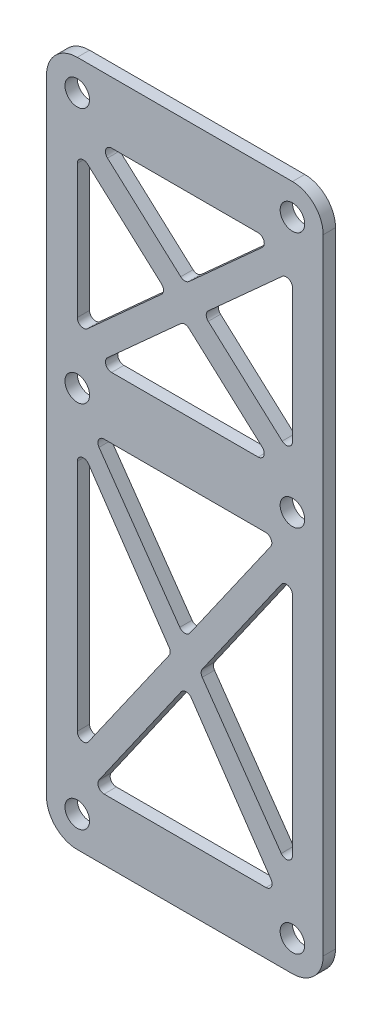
ISO-10303-21;
HEADER;
FILE_DESCRIPTION(('STEP AP214'),'2;1');
FILE_NAME('part.step','',(''),(''),'','','');
FILE_SCHEMA(('AUTOMOTIVE_DESIGN { 1 0 10303 214 1 1 1 1 }'));
ENDSEC;
DATA;
#1=APPLICATION_CONTEXT('core data for automotive mechanical design processes');
#2=APPLICATION_PROTOCOL_DEFINITION('international standard','automotive_design',2000,#1);
#3=PRODUCT_CONTEXT('',#1,'mechanical');
#4=PRODUCT('Part','Part','',(#3));
#5=PRODUCT_RELATED_PRODUCT_CATEGORY('part','',(#4));
#6=PRODUCT_DEFINITION_FORMATION('','',#4);
#7=PRODUCT_DEFINITION_CONTEXT('part definition',#1,'design');
#8=PRODUCT_DEFINITION('design','',#6,#7);
#9=PRODUCT_DEFINITION_SHAPE('','',#8);
#10=(LENGTH_UNIT() NAMED_UNIT(*) SI_UNIT(.MILLI.,.METRE.));
#11=(NAMED_UNIT(*) PLANE_ANGLE_UNIT() SI_UNIT($,.RADIAN.));
#12=(NAMED_UNIT(*) SI_UNIT($,.STERADIAN.) SOLID_ANGLE_UNIT());
#13=UNCERTAINTY_MEASURE_WITH_UNIT(LENGTH_MEASURE(1.E-05),#10,'distance_accuracy_value','');
#14=(GEOMETRIC_REPRESENTATION_CONTEXT(3) GLOBAL_UNCERTAINTY_ASSIGNED_CONTEXT((#13)) GLOBAL_UNIT_ASSIGNED_CONTEXT((#10,
#11,#12)) REPRESENTATION_CONTEXT('',''));
#15=CARTESIAN_POINT('',(0.,0.,0.));
#16=DIRECTION('',(0.,0.,1.));
#17=DIRECTION('',(1.,0.,0.));
#18=AXIS2_PLACEMENT_3D('',#15,#16,#17);
#19=CARTESIAN_POINT('',(-89.7562420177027,-65.4530284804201,2.));
#20=DIRECTION('',(0.,0.,1.));
#21=DIRECTION('',(1.,0.,0.));
#22=AXIS2_PLACEMENT_3D('',#19,#20,#21);
#23=PLANE('',#22);
#24=CARTESIAN_POINT('',(-89.7562420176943,-5.45302848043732,2.));
#25=DIRECTION('',(0.,0.,1.));
#26=DIRECTION('',(1.,0.,0.));
#27=AXIS2_PLACEMENT_3D('',#24,#25,#26);
#28=CIRCLE('',#27,2.00000000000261);
#29=CARTESIAN_POINT('',(-87.7562420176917,-5.45302848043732,2.));
#30=VERTEX_POINT('',#29);
#31=EDGE_CURVE('E911',#30,#30,#28,.T.);
#32=ORIENTED_EDGE('',*,*,#31,.F.);
#33=EDGE_LOOP('',(#32));
#34=FACE_BOUND('',#33,.T.);
#35=CARTESIAN_POINT('',(-54.7562420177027,36.1469715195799,2.));
#36=DIRECTION('',(0.,0.,1.));
#37=DIRECTION('',(1.,0.,0.));
#38=AXIS2_PLACEMENT_3D('',#35,#36,#37);
#39=CIRCLE('',#38,2.00000000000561);
#40=CARTESIAN_POINT('',(-52.7562420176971,36.1469715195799,2.));
#41=VERTEX_POINT('',#40);
#42=EDGE_CURVE('E927',#41,#41,#39,.T.);
#43=ORIENTED_EDGE('',*,*,#42,.F.);
#44=EDGE_LOOP('',(#43));
#45=FACE_BOUND('',#44,.T.);
#46=CARTESIAN_POINT('',(-54.7562420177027,-65.4530284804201,2.));
#47=DIRECTION('',(0.,0.,1.));
#48=DIRECTION('',(1.,0.,0.));
#49=AXIS2_PLACEMENT_3D('',#46,#47,#48);
#50=CIRCLE('',#49,2.00000000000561);
#51=CARTESIAN_POINT('',(-52.7562420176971,-65.4530284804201,2.));
#52=VERTEX_POINT('',#51);
#53=EDGE_CURVE('E943',#52,#52,#50,.T.);
#54=ORIENTED_EDGE('',*,*,#53,.F.);
#55=EDGE_LOOP('',(#54));
#56=FACE_BOUND('',#55,.T.);
#57=CARTESIAN_POINT('',(-89.7562420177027,-65.4530284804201,2.));
#58=DIRECTION('',(0.,0.,1.));
#59=DIRECTION('',(1.,0.,0.));
#60=AXIS2_PLACEMENT_3D('',#57,#58,#59);
#61=CIRCLE('',#60,5.);
#62=CARTESIAN_POINT('',(-94.7562420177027,-65.45302848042,2.));
#63=VERTEX_POINT('',#62);
#64=CARTESIAN_POINT('',(-89.7562420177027,-70.4530284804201,2.));
#65=VERTEX_POINT('',#64);
#66=EDGE_CURVE('E951',#63,#65,#61,.T.);
#67=ORIENTED_EDGE('',*,*,#66,.T.);
#68=DIRECTION('',(1.,0.,0.));
#69=VECTOR('',#68,1.);
#70=CARTESIAN_POINT('',(-89.7562420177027,-70.4530284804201,2.));
#71=LINE('',#70,#69);
#72=CARTESIAN_POINT('',(-54.7562420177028,-70.4530284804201,2.));
#73=VERTEX_POINT('',#72);
#74=EDGE_CURVE('E955',#65,#73,#71,.T.);
#75=ORIENTED_EDGE('',*,*,#74,.T.);
#76=CARTESIAN_POINT('',(-54.7562420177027,-65.4530284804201,2.));
#77=DIRECTION('',(0.,0.,1.));
#78=DIRECTION('',(-1.,0.,0.));
#79=AXIS2_PLACEMENT_3D('',#76,#77,#78);
#80=CIRCLE('',#79,5.);
#81=CARTESIAN_POINT('',(-49.7562420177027,-65.45302848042,2.));
#82=VERTEX_POINT('',#81);
#83=EDGE_CURVE('E959',#73,#82,#80,.T.);
#84=ORIENTED_EDGE('',*,*,#83,.T.);
#85=DIRECTION('',(0.,1.,0.));
#86=VECTOR('',#85,1.);
#87=CARTESIAN_POINT('',(-49.7562420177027,36.1469715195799,2.));
#88=LINE('',#87,#86);
#89=CARTESIAN_POINT('',(-49.7562420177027,36.1469715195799,2.));
#90=VERTEX_POINT('',#89);
#91=EDGE_CURVE('E962',#82,#90,#88,.T.);
#92=ORIENTED_EDGE('',*,*,#91,.T.);
#93=CARTESIAN_POINT('',(-54.7562420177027,36.1469715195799,2.));
#94=DIRECTION('',(0.,0.,1.));
#95=DIRECTION('',(-1.,0.,0.));
#96=AXIS2_PLACEMENT_3D('',#93,#94,#95);
#97=CIRCLE('',#96,5.);
#98=CARTESIAN_POINT('',(-54.7562420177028,41.1469715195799,2.));
#99=VERTEX_POINT('',#98);
#100=EDGE_CURVE('E965',#90,#99,#97,.T.);
#101=ORIENTED_EDGE('',*,*,#100,.T.);
#102=DIRECTION('',(-1.,0.,0.));
#103=VECTOR('',#102,1.);
#104=CARTESIAN_POINT('',(-89.7562420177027,41.1469715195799,2.));
#105=LINE('',#104,#103);
#106=CARTESIAN_POINT('',(-89.7562420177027,41.1469715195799,2.));
#107=VERTEX_POINT('',#106);
#108=EDGE_CURVE('E968',#99,#107,#105,.T.);
#109=ORIENTED_EDGE('',*,*,#108,.T.);
#110=CARTESIAN_POINT('',(-89.7562420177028,36.1469715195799,2.));
#111=DIRECTION('',(0.,0.,1.));
#112=DIRECTION('',(-1.,0.,0.));
#113=AXIS2_PLACEMENT_3D('',#110,#111,#112);
#114=CIRCLE('',#113,5.);
#115=CARTESIAN_POINT('',(-94.7562420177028,36.1469715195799,2.));
#116=VERTEX_POINT('',#115);
#117=EDGE_CURVE('E971',#107,#116,#114,.T.);
#118=ORIENTED_EDGE('',*,*,#117,.T.);
#119=DIRECTION('',(0.,-1.,0.));
#120=VECTOR('',#119,1.);
#121=CARTESIAN_POINT('',(-94.7562420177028,36.1469715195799,2.));
#122=LINE('',#121,#120);
#123=EDGE_CURVE('E974',#116,#63,#122,.T.);
#124=ORIENTED_EDGE('',*,*,#123,.T.);
#125=EDGE_LOOP('',(#67,#75,#84,#92,#101,#109,#118,#124));
#126=FACE_BOUND('',#125,.T.);
#127=CARTESIAN_POINT('',(-54.7562420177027,-5.45302848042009,2.));
#128=DIRECTION('',(0.,0.,1.));
#129=DIRECTION('',(1.,0.,0.));
#130=AXIS2_PLACEMENT_3D('',#127,#128,#129);
#131=CIRCLE('',#130,2.00000000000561);
#132=CARTESIAN_POINT('',(-52.7562420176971,-5.45302848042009,2.));
#133=VERTEX_POINT('',#132);
#134=EDGE_CURVE('E935',#133,#133,#131,.T.);
#135=ORIENTED_EDGE('',*,*,#134,.F.);
#136=EDGE_LOOP('',(#135));
#137=FACE_BOUND('',#136,.T.);
#138=CARTESIAN_POINT('',(-89.7562420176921,36.1469715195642,2.));
#139=DIRECTION('',(0.,0.,1.));
#140=DIRECTION('',(1.,0.,0.));
#141=AXIS2_PLACEMENT_3D('',#138,#139,#140);
#142=CIRCLE('',#141,2.);
#143=CARTESIAN_POINT('',(-87.7562420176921,36.1469715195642,2.));
#144=VERTEX_POINT('',#143);
#145=EDGE_CURVE('E919',#144,#144,#142,.T.);
#146=ORIENTED_EDGE('',*,*,#145,.F.);
#147=EDGE_LOOP('',(#146));
#148=FACE_BOUND('',#147,.T.);
#149=CARTESIAN_POINT('',(-89.7562420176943,-65.4530284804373,2.));
#150=DIRECTION('',(0.,0.,1.));
#151=DIRECTION('',(1.,0.,0.));
#152=AXIS2_PLACEMENT_3D('',#149,#150,#151);
#153=CIRCLE('',#152,2.00000000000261);
#154=CARTESIAN_POINT('',(-87.7562420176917,-65.4530284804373,2.));
#155=VERTEX_POINT('',#154);
#156=EDGE_CURVE('E903',#155,#155,#153,.T.);
#157=ORIENTED_EDGE('',*,*,#156,.F.);
#158=EDGE_LOOP('',(#157));
#159=FACE_BOUND('',#158,.T.);
#160=DIRECTION('',(0.742238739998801,-0.67013554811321,0.));
#161=VECTOR('',#160,1.);
#162=CARTESIAN_POINT('',(-72.9263775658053,18.6465589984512,2.));
#163=LINE('',#162,#161);
#164=CARTESIAN_POINT('',(-84.8420763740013,29.4047327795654,2.));
#165=VERTEX_POINT('',#164);
#166=CARTESIAN_POINT('',(-72.9263775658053,18.6465589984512,2.));
#167=VERTEX_POINT('',#166);
#168=EDGE_CURVE('E843',#165,#167,#163,.T.);
#169=ORIENTED_EDGE('',*,*,#168,.F.);
#170=CARTESIAN_POINT('',(-84.1719408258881,30.1469715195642,2.));
#171=DIRECTION('',(0.,0.,1.));
#172=DIRECTION('',(1.,0.,0.));
#173=AXIS2_PLACEMENT_3D('',#170,#171,#172);
#174=CIRCLE('',#173,0.999999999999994);
#175=CARTESIAN_POINT('',(-84.1719408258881,31.1469715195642,2.));
#176=VERTEX_POINT('',#175);
#177=EDGE_CURVE('E840',#176,#165,#174,.T.);
#178=ORIENTED_EDGE('',*,*,#177,.F.);
#179=DIRECTION('',(-1.,0.,0.));
#180=VECTOR('',#179,1.);
#181=CARTESIAN_POINT('',(-84.1719408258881,31.1469715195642,2.));
#182=LINE('',#181,#180);
#183=CARTESIAN_POINT('',(-60.3405432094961,31.1469715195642,2.));
#184=VERTEX_POINT('',#183);
#185=EDGE_CURVE('E857',#184,#176,#182,.T.);
#186=ORIENTED_EDGE('',*,*,#185,.F.);
#187=CARTESIAN_POINT('',(-60.3405432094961,30.1469715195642,2.));
#188=DIRECTION('',(0.,0.,1.));
#189=DIRECTION('',(-1.,0.,0.));
#190=AXIS2_PLACEMENT_3D('',#187,#188,#189);
#191=CIRCLE('',#190,1.);
#192=CARTESIAN_POINT('',(-59.6704076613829,29.4047327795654,2.));
#193=VERTEX_POINT('',#192);
#194=EDGE_CURVE('E853',#193,#184,#191,.T.);
#195=ORIENTED_EDGE('',*,*,#194,.F.);
#196=DIRECTION('',(0.742238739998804,0.670135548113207,0.));
#197=VECTOR('',#196,1.);
#198=CARTESIAN_POINT('',(-59.6704076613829,29.4047327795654,2.));
#199=LINE('',#198,#197);
#200=CARTESIAN_POINT('',(-71.5861064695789,18.6465589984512,2.));
#201=VERTEX_POINT('',#200);
#202=EDGE_CURVE('E850',#201,#193,#199,.T.);
#203=ORIENTED_EDGE('',*,*,#202,.F.);
#204=CARTESIAN_POINT('',(-72.2562420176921,19.3887977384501,2.));
#205=DIRECTION('',(0.,0.,1.));
#206=DIRECTION('',(1.,0.,0.));
#207=AXIS2_PLACEMENT_3D('',#204,#205,#206);
#208=CIRCLE('',#207,1.00000000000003);
#209=EDGE_CURVE('E847',#167,#201,#208,.T.);
#210=ORIENTED_EDGE('',*,*,#209,.F.);
#211=EDGE_LOOP('',(#169,#178,#186,#195,#203,#210));
#212=FACE_BOUND('',#211,.T.);
#213=DIRECTION('',(-0.742238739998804,0.670135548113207,0.));
#214=VECTOR('',#213,1.);
#215=CARTESIAN_POINT('',(-71.5861064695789,12.0473840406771,2.));
#216=LINE('',#215,#214);
#217=CARTESIAN_POINT('',(-59.6704076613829,1.28921025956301,2.));
#218=VERTEX_POINT('',#217);
#219=CARTESIAN_POINT('',(-71.5861064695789,12.0473840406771,2.));
#220=VERTEX_POINT('',#219);
#221=EDGE_CURVE('E780',#218,#220,#216,.T.);
#222=ORIENTED_EDGE('',*,*,#221,.F.);
#223=CARTESIAN_POINT('',(-60.3405432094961,0.546971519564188,2.));
#224=DIRECTION('',(0.,0.,1.));
#225=DIRECTION('',(1.,0.,0.));
#226=AXIS2_PLACEMENT_3D('',#223,#224,#225);
#227=CIRCLE('',#226,1.00000000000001);
#228=CARTESIAN_POINT('',(-60.3405432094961,-0.453028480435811,2.));
#229=VERTEX_POINT('',#228);
#230=EDGE_CURVE('E777',#229,#218,#227,.T.);
#231=ORIENTED_EDGE('',*,*,#230,.F.);
#232=DIRECTION('',(1.,0.,0.));
#233=VECTOR('',#232,1.);
#234=CARTESIAN_POINT('',(-60.3405432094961,-0.453028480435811,2.));
#235=LINE('',#234,#233);
#236=CARTESIAN_POINT('',(-84.1719408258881,-0.453028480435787,2.));
#237=VERTEX_POINT('',#236);
#238=EDGE_CURVE('E794',#237,#229,#235,.T.);
#239=ORIENTED_EDGE('',*,*,#238,.F.);
#240=CARTESIAN_POINT('',(-84.1719408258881,0.546971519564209,2.));
#241=DIRECTION('',(0.,0.,1.));
#242=DIRECTION('',(-1.,0.,0.));
#243=AXIS2_PLACEMENT_3D('',#240,#241,#242);
#244=CIRCLE('',#243,0.999999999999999);
#245=CARTESIAN_POINT('',(-84.8420763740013,1.28921025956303,2.));
#246=VERTEX_POINT('',#245);
#247=EDGE_CURVE('E790',#246,#237,#244,.T.);
#248=ORIENTED_EDGE('',*,*,#247,.F.);
#249=DIRECTION('',(-0.742238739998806,-0.670135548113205,0.));
#250=VECTOR('',#249,1.);
#251=CARTESIAN_POINT('',(-84.8420763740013,1.28921025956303,2.));
#252=LINE('',#251,#250);
#253=CARTESIAN_POINT('',(-72.9263775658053,12.0473840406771,2.));
#254=VERTEX_POINT('',#253);
#255=EDGE_CURVE('E787',#254,#246,#252,.T.);
#256=ORIENTED_EDGE('',*,*,#255,.F.);
#257=CARTESIAN_POINT('',(-72.2562420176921,11.3051453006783,2.));
#258=DIRECTION('',(0.,0.,1.));
#259=DIRECTION('',(1.,0.,0.));
#260=AXIS2_PLACEMENT_3D('',#257,#258,#259);
#261=CIRCLE('',#260,1.00000000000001);
#262=EDGE_CURVE('E784',#220,#254,#261,.T.);
#263=ORIENTED_EDGE('',*,*,#262,.F.);
#264=EDGE_LOOP('',(#222,#231,#239,#248,#256,#263));
#265=FACE_BOUND('',#264,.T.);
#266=DIRECTION('',(0.742238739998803,-0.670135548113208,0.));
#267=VECTOR('',#266,1.);
#268=CARTESIAN_POINT('',(-56.4263775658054,3.74941614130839,2.));
#269=LINE('',#268,#267);
#270=CARTESIAN_POINT('',(-68.4496713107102,14.6047327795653,2.));
#271=VERTEX_POINT('',#270);
#272=CARTESIAN_POINT('',(-56.4263775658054,3.74941614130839,2.));
#273=VERTEX_POINT('',#272);
#274=EDGE_CURVE('E717',#271,#273,#269,.T.);
#275=ORIENTED_EDGE('',*,*,#274,.F.);
#276=CARTESIAN_POINT('',(-67.779535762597,15.3469715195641,2.));
#277=DIRECTION('',(0.,0.,1.));
#278=DIRECTION('',(-1.,0.,0.));
#279=AXIS2_PLACEMENT_3D('',#276,#277,#278);
#280=CIRCLE('',#279,1.00000000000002);
#281=CARTESIAN_POINT('',(-68.4496713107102,16.0892102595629,2.));
#282=VERTEX_POINT('',#281);
#283=EDGE_CURVE('E714',#282,#271,#280,.T.);
#284=ORIENTED_EDGE('',*,*,#283,.F.);
#285=DIRECTION('',(-0.742238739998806,-0.670135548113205,0.));
#286=VECTOR('',#285,1.);
#287=CARTESIAN_POINT('',(-68.4496713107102,16.0892102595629,2.));
#288=LINE('',#287,#286);
#289=CARTESIAN_POINT('',(-56.4263775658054,26.9445268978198,2.));
#290=VERTEX_POINT('',#289);
#291=EDGE_CURVE('E731',#290,#282,#288,.T.);
#292=ORIENTED_EDGE('',*,*,#291,.F.);
#293=CARTESIAN_POINT('',(-55.7562420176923,26.202288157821,2.));
#294=DIRECTION('',(0.,0.,1.));
#295=DIRECTION('',(1.,0.,0.));
#296=AXIS2_PLACEMENT_3D('',#293,#294,#295);
#297=CIRCLE('',#296,0.999999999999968);
#298=CARTESIAN_POINT('',(-54.7562420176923,26.202288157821,2.));
#299=VERTEX_POINT('',#298);
#300=EDGE_CURVE('E727',#299,#290,#297,.T.);
#301=ORIENTED_EDGE('',*,*,#300,.F.);
#302=DIRECTION('',(0.,1.,0.));
#303=VECTOR('',#302,1.);
#304=CARTESIAN_POINT('',(-54.7562420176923,26.202288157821,2.));
#305=LINE('',#304,#303);
#306=CARTESIAN_POINT('',(-54.7562420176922,4.49165488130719,2.));
#307=VERTEX_POINT('',#306);
#308=EDGE_CURVE('E724',#307,#299,#305,.T.);
#309=ORIENTED_EDGE('',*,*,#308,.F.);
#310=CARTESIAN_POINT('',(-55.7562420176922,4.49165488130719,2.));
#311=DIRECTION('',(0.,0.,1.));
#312=DIRECTION('',(1.,0.,0.));
#313=AXIS2_PLACEMENT_3D('',#310,#311,#312);
#314=CIRCLE('',#313,1.00000000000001);
#315=EDGE_CURVE('E721',#273,#307,#314,.T.);
#316=ORIENTED_EDGE('',*,*,#315,.F.);
#317=EDGE_LOOP('',(#275,#284,#292,#301,#309,#316));
#318=FACE_BOUND('',#317,.T.);
#319=DIRECTION('',(-0.742238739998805,0.670135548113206,0.));
#320=VECTOR('',#319,1.);
#321=CARTESIAN_POINT('',(-88.0861064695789,26.94452689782,2.));
#322=LINE('',#321,#320);
#323=CARTESIAN_POINT('',(-76.062812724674,16.089210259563,2.));
#324=VERTEX_POINT('',#323);
#325=CARTESIAN_POINT('',(-88.0861064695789,26.94452689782,2.));
#326=VERTEX_POINT('',#325);
#327=EDGE_CURVE('E654',#324,#326,#322,.T.);
#328=ORIENTED_EDGE('',*,*,#327,.F.);
#329=CARTESIAN_POINT('',(-76.7329482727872,15.3469715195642,2.));
#330=DIRECTION('',(0.,0.,1.));
#331=DIRECTION('',(-1.,0.,0.));
#332=AXIS2_PLACEMENT_3D('',#329,#330,#331);
#333=CIRCLE('',#332,1.00000000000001);
#334=CARTESIAN_POINT('',(-76.062812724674,14.6047327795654,2.));
#335=VERTEX_POINT('',#334);
#336=EDGE_CURVE('E651',#335,#324,#333,.T.);
#337=ORIENTED_EDGE('',*,*,#336,.F.);
#338=DIRECTION('',(0.742238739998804,0.670135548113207,0.));
#339=VECTOR('',#338,1.);
#340=CARTESIAN_POINT('',(-76.062812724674,14.6047327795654,2.));
#341=LINE('',#340,#339);
#342=CARTESIAN_POINT('',(-88.0861064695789,3.7494161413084,2.));
#343=VERTEX_POINT('',#342);
#344=EDGE_CURVE('E668',#343,#335,#341,.T.);
#345=ORIENTED_EDGE('',*,*,#344,.F.);
#346=CARTESIAN_POINT('',(-88.7562420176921,4.49165488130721,2.));
#347=DIRECTION('',(0.,0.,1.));
#348=DIRECTION('',(1.,0.,0.));
#349=AXIS2_PLACEMENT_3D('',#346,#347,#348);
#350=CIRCLE('',#349,1.);
#351=CARTESIAN_POINT('',(-89.7562420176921,4.49165488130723,2.));
#352=VERTEX_POINT('',#351);
#353=EDGE_CURVE('E664',#352,#343,#350,.T.);
#354=ORIENTED_EDGE('',*,*,#353,.F.);
#355=DIRECTION('',(0.,-1.,0.));
#356=VECTOR('',#355,1.);
#357=CARTESIAN_POINT('',(-89.7562420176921,26.2022881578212,2.));
#358=LINE('',#357,#356);
#359=CARTESIAN_POINT('',(-89.7562420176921,26.2022881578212,2.));
#360=VERTEX_POINT('',#359);
#361=EDGE_CURVE('E661',#360,#352,#358,.T.);
#362=ORIENTED_EDGE('',*,*,#361,.F.);
#363=CARTESIAN_POINT('',(-88.7562420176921,26.2022881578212,2.));
#364=DIRECTION('',(0.,0.,1.));
#365=DIRECTION('',(1.,0.,0.));
#366=AXIS2_PLACEMENT_3D('',#363,#364,#365);
#367=CIRCLE('',#366,1.00000000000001);
#368=EDGE_CURVE('E658',#326,#360,#367,.T.);
#369=ORIENTED_EDGE('',*,*,#368,.F.);
#370=EDGE_LOOP('',(#328,#337,#345,#354,#362,#369));
#371=FACE_BOUND('',#370,.T.);
#372=DIRECTION('',(0.573207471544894,-0.819410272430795,0.));
#373=VECTOR('',#372,1.);
#374=CARTESIAN_POINT('',(-73.0814212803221,-30.8059906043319,2.));
#375=LINE('',#374,#373);
#376=CARTESIAN_POINT('',(-86.2185468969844,-12.0262359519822,2.));
#377=VERTEX_POINT('',#376);
#378=CARTESIAN_POINT('',(-73.0814212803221,-30.8059906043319,2.));
#379=VERTEX_POINT('',#378);
#380=EDGE_CURVE('E591',#377,#379,#375,.T.);
#381=ORIENTED_EDGE('',*,*,#380,.F.);
#382=CARTESIAN_POINT('',(-85.3991366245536,-11.4530284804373,2.));
#383=DIRECTION('',(0.,0.,1.));
#384=DIRECTION('',(-1.,0.,0.));
#385=AXIS2_PLACEMENT_3D('',#382,#383,#384);
#386=CIRCLE('',#385,0.999999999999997);
#387=CARTESIAN_POINT('',(-85.3991366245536,-10.4530284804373,2.));
#388=VERTEX_POINT('',#387);
#389=EDGE_CURVE('E588',#388,#377,#386,.T.);
#390=ORIENTED_EDGE('',*,*,#389,.F.);
#391=DIRECTION('',(-1.,0.,0.));
#392=VECTOR('',#391,1.);
#393=CARTESIAN_POINT('',(-85.3991366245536,-10.4530284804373,2.));
#394=LINE('',#393,#392);
#395=CARTESIAN_POINT('',(-59.114847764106,-10.4530284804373,2.));
#396=VERTEX_POINT('',#395);
#397=EDGE_CURVE('E605',#396,#388,#394,.T.);
#398=ORIENTED_EDGE('',*,*,#397,.F.);
#399=CARTESIAN_POINT('',(-59.114847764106,-11.4530284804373,2.));
#400=DIRECTION('',(0.,0.,1.));
#401=DIRECTION('',(1.,0.,0.));
#402=AXIS2_PLACEMENT_3D('',#399,#400,#401);
#403=CIRCLE('',#402,1.);
#404=CARTESIAN_POINT('',(-58.2956432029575,-12.0265299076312,2.));
#405=VERTEX_POINT('',#404);
#406=EDGE_CURVE('E601',#405,#396,#403,.T.);
#407=ORIENTED_EDGE('',*,*,#406,.F.);
#408=DIRECTION('',(0.573501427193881,0.819204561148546,0.));
#409=VECTOR('',#408,1.);
#410=CARTESIAN_POINT('',(-58.2956432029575,-12.0265299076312,2.));
#411=LINE('',#410,#409);
#412=CARTESIAN_POINT('',(-71.4428064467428,-30.8062845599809,2.));
#413=VERTEX_POINT('',#412);
#414=EDGE_CURVE('E598',#413,#405,#411,.T.);
#415=ORIENTED_EDGE('',*,*,#414,.F.);
#416=CARTESIAN_POINT('',(-72.2620110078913,-30.232783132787,2.));
#417=DIRECTION('',(0.,0.,1.));
#418=DIRECTION('',(-1.,0.,0.));
#419=AXIS2_PLACEMENT_3D('',#416,#417,#418);
#420=CIRCLE('',#419,0.999999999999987);
#421=EDGE_CURVE('E595',#379,#413,#420,.T.);
#422=ORIENTED_EDGE('',*,*,#421,.F.);
#423=EDGE_LOOP('',(#381,#390,#398,#407,#415,#422));
#424=FACE_BOUND('',#423,.T.);
#425=DIRECTION('',(-0.573207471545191,-0.819410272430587,0.));
#426=VECTOR('',#425,1.);
#427=CARTESIAN_POINT('',(-72.8621323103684,-39.7865888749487,2.));
#428=LINE('',#427,#426);
#429=CARTESIAN_POINT('',(-72.8621323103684,-39.7865888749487,2.));
#430=VERTEX_POINT('',#429);
#431=CARTESIAN_POINT('',(-86.2185468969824,-58.8798210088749,2.));
#432=VERTEX_POINT('',#431);
#433=EDGE_CURVE('E528',#430,#432,#428,.T.);
#434=ORIENTED_EDGE('',*,*,#433,.F.);
#435=CARTESIAN_POINT('',(-72.0427220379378,-40.3597963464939,2.));
#436=DIRECTION('',(0.,0.,1.));
#437=DIRECTION('',(1.,0.,0.));
#438=AXIS2_PLACEMENT_3D('',#435,#436,#437);
#439=CIRCLE('',#438,1.);
#440=CARTESIAN_POINT('',(-71.2157106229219,-39.7976112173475,2.));
#441=VERTEX_POINT('',#440);
#442=EDGE_CURVE('E525',#441,#430,#439,.T.);
#443=ORIENTED_EDGE('',*,*,#442,.F.);
#444=DIRECTION('',(-0.562185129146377,0.827011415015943,0.));
#445=VECTOR('',#444,1.);
#446=CARTESIAN_POINT('',(-71.2157106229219,-39.7976112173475,2.));
#447=LINE('',#446,#445);
#448=CARTESIAN_POINT('',(-58.2365292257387,-58.8908433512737,2.));
#449=VERTEX_POINT('',#448);
#450=EDGE_CURVE('E542',#449,#441,#447,.T.);
#451=ORIENTED_EDGE('',*,*,#450,.F.);
#452=CARTESIAN_POINT('',(-59.0635406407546,-59.4530284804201,2.));
#453=DIRECTION('',(0.,0.,1.));
#454=DIRECTION('',(1.,0.,0.));
#455=AXIS2_PLACEMENT_3D('',#452,#453,#454);
#456=CIRCLE('',#455,1.);
#457=CARTESIAN_POINT('',(-59.0635406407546,-60.4530284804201,2.));
#458=VERTEX_POINT('',#457);
#459=EDGE_CURVE('E538',#458,#449,#456,.T.);
#460=ORIENTED_EDGE('',*,*,#459,.F.);
#461=DIRECTION('',(1.,0.,0.));
#462=VECTOR('',#461,1.);
#463=CARTESIAN_POINT('',(-59.0635406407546,-60.4530284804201,2.));
#464=LINE('',#463,#462);
#465=CARTESIAN_POINT('',(-85.3991366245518,-60.4530284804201,2.));
#466=VERTEX_POINT('',#465);
#467=EDGE_CURVE('E535',#466,#458,#464,.T.);
#468=ORIENTED_EDGE('',*,*,#467,.F.);
#469=CARTESIAN_POINT('',(-85.3991366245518,-59.4530284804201,2.));
#470=DIRECTION('',(0.,0.,1.));
#471=DIRECTION('',(-1.,0.,0.));
#472=AXIS2_PLACEMENT_3D('',#469,#470,#471);
#473=CIRCLE('',#472,1.);
#474=EDGE_CURVE('E532',#432,#466,#473,.T.);
#475=ORIENTED_EDGE('',*,*,#474,.F.);
#476=EDGE_LOOP('',(#434,#443,#451,#460,#468,#475));
#477=FACE_BOUND('',#476,.T.);
#478=DIRECTION('',(0.573207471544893,-0.819410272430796,0.));
#479=VECTOR('',#478,1.);
#480=CARTESIAN_POINT('',(-56.5756522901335,-54.4012808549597,2.));
#481=LINE('',#480,#479);
#482=CARTESIAN_POINT('',(-69.4296686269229,-36.0262359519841,2.));
#483=VERTEX_POINT('',#482);
#484=CARTESIAN_POINT('',(-56.5756522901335,-54.4012808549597,2.));
#485=VERTEX_POINT('',#484);
#486=EDGE_CURVE('E465',#483,#485,#481,.T.);
#487=ORIENTED_EDGE('',*,*,#486,.F.);
#488=CARTESIAN_POINT('',(-68.6102583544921,-35.4530284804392,2.));
#489=DIRECTION('',(0.,0.,1.));
#490=DIRECTION('',(1.,0.,0.));
#491=AXIS2_PLACEMENT_3D('',#488,#489,#490);
#492=CIRCLE('',#491,0.999999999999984);
#493=CARTESIAN_POINT('',(-69.4296686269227,-34.879821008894,2.));
#494=VERTEX_POINT('',#493);
#495=EDGE_CURVE('E462',#494,#483,#492,.T.);
#496=ORIENTED_EDGE('',*,*,#495,.F.);
#497=DIRECTION('',(-0.573207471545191,-0.819410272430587,0.));
#498=VECTOR('',#497,1.);
#499=CARTESIAN_POINT('',(-56.5756522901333,-16.5047761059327,2.));
#500=LINE('',#499,#498);
#501=CARTESIAN_POINT('',(-56.5756522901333,-16.5047761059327,2.));
#502=VERTEX_POINT('',#501);
#503=EDGE_CURVE('E479',#502,#494,#500,.T.);
#504=ORIENTED_EDGE('',*,*,#503,.F.);
#505=CARTESIAN_POINT('',(-55.7562420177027,-17.0779835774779,2.));
#506=DIRECTION('',(0.,0.,1.));
#507=DIRECTION('',(-1.,0.,0.));
#508=AXIS2_PLACEMENT_3D('',#505,#506,#507);
#509=CIRCLE('',#508,0.999999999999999);
#510=CARTESIAN_POINT('',(-54.7562420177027,-17.0779835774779,2.));
#511=VERTEX_POINT('',#510);
#512=EDGE_CURVE('E475',#511,#502,#509,.T.);
#513=ORIENTED_EDGE('',*,*,#512,.F.);
#514=DIRECTION('',(0.,1.,0.));
#515=VECTOR('',#514,1.);
#516=CARTESIAN_POINT('',(-54.7562420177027,-17.0779835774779,2.));
#517=LINE('',#516,#515);
#518=CARTESIAN_POINT('',(-54.7562420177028,-53.8280733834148,2.));
#519=VERTEX_POINT('',#518);
#520=EDGE_CURVE('E472',#519,#511,#517,.T.);
#521=ORIENTED_EDGE('',*,*,#520,.F.);
#522=CARTESIAN_POINT('',(-55.7562420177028,-53.8280733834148,2.));
#523=DIRECTION('',(0.,0.,1.));
#524=DIRECTION('',(-1.,0.,0.));
#525=AXIS2_PLACEMENT_3D('',#522,#523,#524);
#526=CIRCLE('',#525,0.999999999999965);
#527=EDGE_CURVE('E469',#485,#519,#526,.T.);
#528=ORIENTED_EDGE('',*,*,#527,.F.);
#529=EDGE_LOOP('',(#487,#496,#504,#513,#521,#528));
#530=FACE_BOUND('',#529,.T.);
#531=DIRECTION('',(-0.562185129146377,0.827011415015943,0.));
#532=VECTOR('',#531,1.);
#533=CARTESIAN_POINT('',(-87.9292306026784,-15.2109206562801,2.));
#534=LINE('',#533,#532);
#535=CARTESIAN_POINT('',(-74.816427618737,-34.5007189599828,2.));
#536=VERTEX_POINT('',#535);
#537=CARTESIAN_POINT('',(-87.9292306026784,-15.2109206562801,2.));
#538=VERTEX_POINT('',#537);
#539=EDGE_CURVE('E402',#536,#538,#534,.T.);
#540=ORIENTED_EDGE('',*,*,#539,.F.);
#541=CARTESIAN_POINT('',(-75.6434390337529,-35.0629040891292,2.));
#542=DIRECTION('',(0.,0.,1.));
#543=DIRECTION('',(-1.,0.,0.));
#544=AXIS2_PLACEMENT_3D('',#541,#542,#543);
#545=CIRCLE('',#544,1.00000000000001);
#546=CARTESIAN_POINT('',(-74.8242344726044,-35.6364055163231,2.));
#547=VERTEX_POINT('',#546);
#548=EDGE_CURVE('E393',#547,#536,#545,.T.);
#549=ORIENTED_EDGE('',*,*,#548,.F.);
#550=DIRECTION('',(0.573501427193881,0.819204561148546,0.));
#551=VECTOR('',#550,1.);
#552=CARTESIAN_POINT('',(-74.8242344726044,-35.6364055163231,2.));
#553=LINE('',#552,#551);
#554=CARTESIAN_POINT('',(-87.9370374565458,-54.3670790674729,2.));
#555=VERTEX_POINT('',#554);
#556=EDGE_CURVE('E428',#555,#547,#553,.T.);
#557=ORIENTED_EDGE('',*,*,#556,.F.);
#558=CARTESIAN_POINT('',(-88.7562420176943,-53.793577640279,2.));
#559=DIRECTION('',(0.,0.,1.));
#560=DIRECTION('',(-1.,0.,0.));
#561=AXIS2_PLACEMENT_3D('',#558,#559,#560);
#562=CIRCLE('',#561,0.999999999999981);
#563=CARTESIAN_POINT('',(-89.7562420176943,-53.7935776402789,2.));
#564=VERTEX_POINT('',#563);
#565=EDGE_CURVE('E425',#564,#555,#562,.T.);
#566=ORIENTED_EDGE('',*,*,#565,.F.);
#567=DIRECTION('',(0.,-1.,0.));
#568=VECTOR('',#567,1.);
#569=CARTESIAN_POINT('',(-89.7562420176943,-53.7935776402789,2.));
#570=LINE('',#569,#568);
#571=CARTESIAN_POINT('',(-89.7562420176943,-15.7731057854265,2.));
#572=VERTEX_POINT('',#571);
#573=EDGE_CURVE('E420',#572,#564,#570,.T.);
#574=ORIENTED_EDGE('',*,*,#573,.F.);
#575=CARTESIAN_POINT('',(-88.7562420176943,-15.7731057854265,2.));
#576=DIRECTION('',(0.,0.,1.));
#577=DIRECTION('',(-1.,0.,0.));
#578=AXIS2_PLACEMENT_3D('',#575,#576,#577);
#579=CIRCLE('',#578,1.);
#580=EDGE_CURVE('E416',#538,#572,#579,.T.);
#581=ORIENTED_EDGE('',*,*,#580,.F.);
#582=EDGE_LOOP('',(#540,#549,#557,#566,#574,#581));
#583=FACE_BOUND('',#582,.T.);
#584=ADVANCED_FACE('F39',(#34,#45,#56,#126,#137,#148,#159,#212,#265,#318,#371,#424,#477,#530,
#583),#23,.T.);
#585=CARTESIAN_POINT('',(-89.7562420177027,-65.4530284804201,0.));
#586=DIRECTION('',(0.,0.,1.));
#587=DIRECTION('',(1.,0.,0.));
#588=AXIS2_PLACEMENT_3D('',#585,#586,#587);
#589=PLANE('',#588);
#590=CARTESIAN_POINT('',(-68.6102583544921,-35.4530284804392,0.));
#591=DIRECTION('',(0.,0.,1.));
#592=DIRECTION('',(1.,0.,0.));
#593=AXIS2_PLACEMENT_3D('',#590,#591,#592);
#594=CIRCLE('',#593,0.999999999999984);
#595=CARTESIAN_POINT('',(-69.4296686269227,-34.879821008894,0.));
#596=VERTEX_POINT('',#595);
#597=CARTESIAN_POINT('',(-69.4296686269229,-36.0262359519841,0.));
#598=VERTEX_POINT('',#597);
#599=EDGE_CURVE('E411',#596,#598,#594,.T.);
#600=ORIENTED_EDGE('',*,*,#599,.T.);
#601=DIRECTION('',(0.573207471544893,-0.819410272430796,0.));
#602=VECTOR('',#601,1.);
#603=CARTESIAN_POINT('',(-56.5756522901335,-54.4012808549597,0.));
#604=LINE('',#603,#602);
#605=CARTESIAN_POINT('',(-56.5756522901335,-54.4012808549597,0.));
#606=VERTEX_POINT('',#605);
#607=EDGE_CURVE('E486',#598,#606,#604,.T.);
#608=ORIENTED_EDGE('',*,*,#607,.T.);
#609=CARTESIAN_POINT('',(-55.7562420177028,-53.8280733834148,0.));
#610=DIRECTION('',(0.,0.,1.));
#611=DIRECTION('',(-1.,0.,0.));
#612=AXIS2_PLACEMENT_3D('',#609,#610,#611);
#613=CIRCLE('',#612,0.999999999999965);
#614=CARTESIAN_POINT('',(-54.7562420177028,-53.8280733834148,0.));
#615=VERTEX_POINT('',#614);
#616=EDGE_CURVE('E490',#606,#615,#613,.T.);
#617=ORIENTED_EDGE('',*,*,#616,.T.);
#618=DIRECTION('',(0.,1.,0.));
#619=VECTOR('',#618,1.);
#620=CARTESIAN_POINT('',(-54.7562420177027,-17.0779835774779,0.));
#621=LINE('',#620,#619);
#622=CARTESIAN_POINT('',(-54.7562420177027,-17.0779835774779,0.));
#623=VERTEX_POINT('',#622);
#624=EDGE_CURVE('E494',#615,#623,#621,.T.);
#625=ORIENTED_EDGE('',*,*,#624,.T.);
#626=CARTESIAN_POINT('',(-55.7562420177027,-17.0779835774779,0.));
#627=DIRECTION('',(0.,0.,1.));
#628=DIRECTION('',(-1.,0.,0.));
#629=AXIS2_PLACEMENT_3D('',#626,#627,#628);
#630=CIRCLE('',#629,0.999999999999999);
#631=CARTESIAN_POINT('',(-56.5756522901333,-16.5047761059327,0.));
#632=VERTEX_POINT('',#631);
#633=EDGE_CURVE('E498',#623,#632,#630,.T.);
#634=ORIENTED_EDGE('',*,*,#633,.T.);
#635=DIRECTION('',(-0.573207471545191,-0.819410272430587,0.));
#636=VECTOR('',#635,1.);
#637=CARTESIAN_POINT('',(-56.5756522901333,-16.5047761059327,0.));
#638=LINE('',#637,#636);
#639=EDGE_CURVE('E466',#632,#596,#638,.T.);
#640=ORIENTED_EDGE('',*,*,#639,.T.);
#641=EDGE_LOOP('',(#600,#608,#617,#625,#634,#640));
#642=FACE_BOUND('',#641,.T.);
#643=CARTESIAN_POINT('',(-85.3991366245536,-11.4530284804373,0.));
#644=DIRECTION('',(0.,0.,1.));
#645=DIRECTION('',(-1.,0.,0.));
#646=AXIS2_PLACEMENT_3D('',#643,#644,#645);
#647=CIRCLE('',#646,0.999999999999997);
#648=CARTESIAN_POINT('',(-85.3991366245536,-10.4530284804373,0.));
#649=VERTEX_POINT('',#648);
#650=CARTESIAN_POINT('',(-86.2185468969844,-12.0262359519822,0.));
#651=VERTEX_POINT('',#650);
#652=EDGE_CURVE('E587',#649,#651,#647,.T.);
#653=ORIENTED_EDGE('',*,*,#652,.T.);
#654=DIRECTION('',(0.573207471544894,-0.819410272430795,0.));
#655=VECTOR('',#654,1.);
#656=CARTESIAN_POINT('',(-73.0814212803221,-30.8059906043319,0.));
#657=LINE('',#656,#655);
#658=CARTESIAN_POINT('',(-73.0814212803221,-30.8059906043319,0.));
#659=VERTEX_POINT('',#658);
#660=EDGE_CURVE('E612',#651,#659,#657,.T.);
#661=ORIENTED_EDGE('',*,*,#660,.T.);
#662=CARTESIAN_POINT('',(-72.2620110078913,-30.232783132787,0.));
#663=DIRECTION('',(0.,0.,1.));
#664=DIRECTION('',(-1.,0.,0.));
#665=AXIS2_PLACEMENT_3D('',#662,#663,#664);
#666=CIRCLE('',#665,0.999999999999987);
#667=CARTESIAN_POINT('',(-71.4428064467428,-30.8062845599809,0.));
#668=VERTEX_POINT('',#667);
#669=EDGE_CURVE('E616',#659,#668,#666,.T.);
#670=ORIENTED_EDGE('',*,*,#669,.T.);
#671=DIRECTION('',(0.573501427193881,0.819204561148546,0.));
#672=VECTOR('',#671,1.);
#673=CARTESIAN_POINT('',(-58.2956432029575,-12.0265299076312,0.));
#674=LINE('',#673,#672);
#675=CARTESIAN_POINT('',(-58.2956432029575,-12.0265299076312,0.));
#676=VERTEX_POINT('',#675);
#677=EDGE_CURVE('E620',#668,#676,#674,.T.);
#678=ORIENTED_EDGE('',*,*,#677,.T.);
#679=CARTESIAN_POINT('',(-59.114847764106,-11.4530284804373,0.));
#680=DIRECTION('',(0.,0.,1.));
#681=DIRECTION('',(1.,0.,0.));
#682=AXIS2_PLACEMENT_3D('',#679,#680,#681);
#683=CIRCLE('',#682,1.);
#684=CARTESIAN_POINT('',(-59.114847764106,-10.4530284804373,0.));
#685=VERTEX_POINT('',#684);
#686=EDGE_CURVE('E624',#676,#685,#683,.T.);
#687=ORIENTED_EDGE('',*,*,#686,.T.);
#688=DIRECTION('',(-1.,0.,0.));
#689=VECTOR('',#688,1.);
#690=CARTESIAN_POINT('',(-85.3991366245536,-10.4530284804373,0.));
#691=LINE('',#690,#689);
#692=EDGE_CURVE('E592',#685,#649,#691,.T.);
#693=ORIENTED_EDGE('',*,*,#692,.T.);
#694=EDGE_LOOP('',(#653,#661,#670,#678,#687,#693));
#695=FACE_BOUND('',#694,.T.);
#696=CARTESIAN_POINT('',(-67.779535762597,15.3469715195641,0.));
#697=DIRECTION('',(0.,0.,1.));
#698=DIRECTION('',(-1.,0.,0.));
#699=AXIS2_PLACEMENT_3D('',#696,#697,#698);
#700=CIRCLE('',#699,1.00000000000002);
#701=CARTESIAN_POINT('',(-68.4496713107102,16.0892102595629,0.));
#702=VERTEX_POINT('',#701);
#703=CARTESIAN_POINT('',(-68.4496713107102,14.6047327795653,0.));
#704=VERTEX_POINT('',#703);
#705=EDGE_CURVE('E713',#702,#704,#700,.T.);
#706=ORIENTED_EDGE('',*,*,#705,.T.);
#707=DIRECTION('',(0.742238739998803,-0.670135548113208,0.));
#708=VECTOR('',#707,1.);
#709=CARTESIAN_POINT('',(-56.4263775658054,3.74941614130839,0.));
#710=LINE('',#709,#708);
#711=CARTESIAN_POINT('',(-56.4263775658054,3.74941614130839,0.));
#712=VERTEX_POINT('',#711);
#713=EDGE_CURVE('E738',#704,#712,#710,.T.);
#714=ORIENTED_EDGE('',*,*,#713,.T.);
#715=CARTESIAN_POINT('',(-55.7562420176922,4.49165488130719,0.));
#716=DIRECTION('',(0.,0.,1.));
#717=DIRECTION('',(1.,0.,0.));
#718=AXIS2_PLACEMENT_3D('',#715,#716,#717);
#719=CIRCLE('',#718,1.00000000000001);
#720=CARTESIAN_POINT('',(-54.7562420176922,4.49165488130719,0.));
#721=VERTEX_POINT('',#720);
#722=EDGE_CURVE('E742',#712,#721,#719,.T.);
#723=ORIENTED_EDGE('',*,*,#722,.T.);
#724=DIRECTION('',(0.,1.,0.));
#725=VECTOR('',#724,1.);
#726=CARTESIAN_POINT('',(-54.7562420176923,26.202288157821,0.));
#727=LINE('',#726,#725);
#728=CARTESIAN_POINT('',(-54.7562420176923,26.202288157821,0.));
#729=VERTEX_POINT('',#728);
#730=EDGE_CURVE('E746',#721,#729,#727,.T.);
#731=ORIENTED_EDGE('',*,*,#730,.T.);
#732=CARTESIAN_POINT('',(-55.7562420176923,26.202288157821,0.));
#733=DIRECTION('',(0.,0.,1.));
#734=DIRECTION('',(1.,0.,0.));
#735=AXIS2_PLACEMENT_3D('',#732,#733,#734);
#736=CIRCLE('',#735,0.999999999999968);
#737=CARTESIAN_POINT('',(-56.4263775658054,26.9445268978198,0.));
#738=VERTEX_POINT('',#737);
#739=EDGE_CURVE('E750',#729,#738,#736,.T.);
#740=ORIENTED_EDGE('',*,*,#739,.T.);
#741=DIRECTION('',(-0.742238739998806,-0.670135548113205,0.));
#742=VECTOR('',#741,1.);
#743=CARTESIAN_POINT('',(-68.4496713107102,16.0892102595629,0.));
#744=LINE('',#743,#742);
#745=EDGE_CURVE('E718',#738,#702,#744,.T.);
#746=ORIENTED_EDGE('',*,*,#745,.T.);
#747=EDGE_LOOP('',(#706,#714,#723,#731,#740,#746));
#748=FACE_BOUND('',#747,.T.);
#749=CARTESIAN_POINT('',(-84.1719408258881,30.1469715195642,0.));
#750=DIRECTION('',(0.,0.,1.));
#751=DIRECTION('',(1.,0.,0.));
#752=AXIS2_PLACEMENT_3D('',#749,#750,#751);
#753=CIRCLE('',#752,0.999999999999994);
#754=CARTESIAN_POINT('',(-84.1719408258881,31.1469715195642,0.));
#755=VERTEX_POINT('',#754);
#756=CARTESIAN_POINT('',(-84.8420763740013,29.4047327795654,0.));
#757=VERTEX_POINT('',#756);
#758=EDGE_CURVE('E839',#755,#757,#753,.T.);
#759=ORIENTED_EDGE('',*,*,#758,.T.);
#760=DIRECTION('',(0.742238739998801,-0.67013554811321,0.));
#761=VECTOR('',#760,1.);
#762=CARTESIAN_POINT('',(-72.9263775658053,18.6465589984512,0.));
#763=LINE('',#762,#761);
#764=CARTESIAN_POINT('',(-72.9263775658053,18.6465589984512,0.));
#765=VERTEX_POINT('',#764);
#766=EDGE_CURVE('E864',#757,#765,#763,.T.);
#767=ORIENTED_EDGE('',*,*,#766,.T.);
#768=CARTESIAN_POINT('',(-72.2562420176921,19.3887977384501,0.));
#769=DIRECTION('',(0.,0.,1.));
#770=DIRECTION('',(1.,0.,0.));
#771=AXIS2_PLACEMENT_3D('',#768,#769,#770);
#772=CIRCLE('',#771,1.00000000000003);
#773=CARTESIAN_POINT('',(-71.5861064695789,18.6465589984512,0.));
#774=VERTEX_POINT('',#773);
#775=EDGE_CURVE('E868',#765,#774,#772,.T.);
#776=ORIENTED_EDGE('',*,*,#775,.T.);
#777=DIRECTION('',(0.742238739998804,0.670135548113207,0.));
#778=VECTOR('',#777,1.);
#779=CARTESIAN_POINT('',(-59.6704076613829,29.4047327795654,0.));
#780=LINE('',#779,#778);
#781=CARTESIAN_POINT('',(-59.6704076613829,29.4047327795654,0.));
#782=VERTEX_POINT('',#781);
#783=EDGE_CURVE('E872',#774,#782,#780,.T.);
#784=ORIENTED_EDGE('',*,*,#783,.T.);
#785=CARTESIAN_POINT('',(-60.3405432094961,30.1469715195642,0.));
#786=DIRECTION('',(0.,0.,1.));
#787=DIRECTION('',(-1.,0.,0.));
#788=AXIS2_PLACEMENT_3D('',#785,#786,#787);
#789=CIRCLE('',#788,1.);
#790=CARTESIAN_POINT('',(-60.3405432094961,31.1469715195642,0.));
#791=VERTEX_POINT('',#790);
#792=EDGE_CURVE('E876',#782,#791,#789,.T.);
#793=ORIENTED_EDGE('',*,*,#792,.T.);
#794=DIRECTION('',(-1.,0.,0.));
#795=VECTOR('',#794,1.);
#796=CARTESIAN_POINT('',(-84.1719408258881,31.1469715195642,0.));
#797=LINE('',#796,#795);
#798=EDGE_CURVE('E844',#791,#755,#797,.T.);
#799=ORIENTED_EDGE('',*,*,#798,.T.);
#800=EDGE_LOOP('',(#759,#767,#776,#784,#793,#799));
#801=FACE_BOUND('',#800,.T.);
#802=CARTESIAN_POINT('',(-89.7562420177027,-65.4530284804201,0.));
#803=DIRECTION('',(0.,0.,1.));
#804=DIRECTION('',(1.,0.,0.));
#805=AXIS2_PLACEMENT_3D('',#802,#803,#804);
#806=CIRCLE('',#805,5.);
#807=CARTESIAN_POINT('',(-94.7562420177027,-65.45302848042,0.));
#808=VERTEX_POINT('',#807);
#809=CARTESIAN_POINT('',(-89.7562420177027,-70.4530284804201,0.));
#810=VERTEX_POINT('',#809);
#811=EDGE_CURVE('E947',#808,#810,#806,.T.);
#812=ORIENTED_EDGE('',*,*,#811,.F.);
#813=DIRECTION('',(0.,-1.,0.));
#814=VECTOR('',#813,1.);
#815=CARTESIAN_POINT('',(-94.7562420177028,36.1469715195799,0.));
#816=LINE('',#815,#814);
#817=CARTESIAN_POINT('',(-94.7562420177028,36.1469715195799,0.));
#818=VERTEX_POINT('',#817);
#819=EDGE_CURVE('E956',#818,#808,#816,.T.);
#820=ORIENTED_EDGE('',*,*,#819,.F.);
#821=CARTESIAN_POINT('',(-89.7562420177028,36.1469715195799,0.));
#822=DIRECTION('',(0.,0.,1.));
#823=DIRECTION('',(-1.,0.,0.));
#824=AXIS2_PLACEMENT_3D('',#821,#822,#823);
#825=CIRCLE('',#824,5.);
#826=CARTESIAN_POINT('',(-89.7562420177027,41.1469715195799,0.));
#827=VERTEX_POINT('',#826);
#828=EDGE_CURVE('E996',#827,#818,#825,.T.);
#829=ORIENTED_EDGE('',*,*,#828,.F.);
#830=DIRECTION('',(-1.,0.,0.));
#831=VECTOR('',#830,1.);
#832=CARTESIAN_POINT('',(-89.7562420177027,41.1469715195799,0.));
#833=LINE('',#832,#831);
#834=CARTESIAN_POINT('',(-54.7562420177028,41.1469715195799,0.));
#835=VERTEX_POINT('',#834);
#836=EDGE_CURVE('E993',#835,#827,#833,.T.);
#837=ORIENTED_EDGE('',*,*,#836,.F.);
#838=CARTESIAN_POINT('',(-54.7562420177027,36.1469715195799,0.));
#839=DIRECTION('',(0.,0.,1.));
#840=DIRECTION('',(-1.,0.,0.));
#841=AXIS2_PLACEMENT_3D('',#838,#839,#840);
#842=CIRCLE('',#841,5.);
#843=CARTESIAN_POINT('',(-49.7562420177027,36.1469715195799,0.));
#844=VERTEX_POINT('',#843);
#845=EDGE_CURVE('E990',#844,#835,#842,.T.);
#846=ORIENTED_EDGE('',*,*,#845,.F.);
#847=DIRECTION('',(0.,1.,0.));
#848=VECTOR('',#847,1.);
#849=CARTESIAN_POINT('',(-49.7562420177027,36.1469715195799,0.));
#850=LINE('',#849,#848);
#851=CARTESIAN_POINT('',(-49.7562420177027,-65.45302848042,0.));
#852=VERTEX_POINT('',#851);
#853=EDGE_CURVE('E987',#852,#844,#850,.T.);
#854=ORIENTED_EDGE('',*,*,#853,.F.);
#855=CARTESIAN_POINT('',(-54.7562420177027,-65.4530284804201,0.));
#856=DIRECTION('',(0.,0.,1.));
#857=DIRECTION('',(-1.,0.,0.));
#858=AXIS2_PLACEMENT_3D('',#855,#856,#857);
#859=CIRCLE('',#858,5.);
#860=CARTESIAN_POINT('',(-54.7562420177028,-70.4530284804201,0.));
#861=VERTEX_POINT('',#860);
#862=EDGE_CURVE('E984',#861,#852,#859,.T.);
#863=ORIENTED_EDGE('',*,*,#862,.F.);
#864=DIRECTION('',(1.,0.,0.));
#865=VECTOR('',#864,1.);
#866=CARTESIAN_POINT('',(-89.7562420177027,-70.4530284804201,0.));
#867=LINE('',#866,#865);
#868=EDGE_CURVE('E981',#810,#861,#867,.T.);
#869=ORIENTED_EDGE('',*,*,#868,.F.);
#870=EDGE_LOOP('',(#812,#820,#829,#837,#846,#854,#863,#869));
#871=FACE_BOUND('',#870,.T.);
#872=CARTESIAN_POINT('',(-54.7562420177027,-65.4530284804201,0.));
#873=DIRECTION('',(0.,0.,1.));
#874=DIRECTION('',(1.,0.,0.));
#875=AXIS2_PLACEMENT_3D('',#872,#873,#874);
#876=CIRCLE('',#875,2.00000000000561);
#877=CARTESIAN_POINT('',(-52.7562420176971,-65.4530284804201,0.));
#878=VERTEX_POINT('',#877);
#879=EDGE_CURVE('E939',#878,#878,#876,.T.);
#880=ORIENTED_EDGE('',*,*,#879,.T.);
#881=EDGE_LOOP('',(#880));
#882=FACE_BOUND('',#881,.T.);
#883=CARTESIAN_POINT('',(-54.7562420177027,-5.45302848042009,0.));
#884=DIRECTION('',(0.,0.,1.));
#885=DIRECTION('',(1.,0.,0.));
#886=AXIS2_PLACEMENT_3D('',#883,#884,#885);
#887=CIRCLE('',#886,2.00000000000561);
#888=CARTESIAN_POINT('',(-52.7562420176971,-5.45302848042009,0.));
#889=VERTEX_POINT('',#888);
#890=EDGE_CURVE('E931',#889,#889,#887,.T.);
#891=ORIENTED_EDGE('',*,*,#890,.T.);
#892=EDGE_LOOP('',(#891));
#893=FACE_BOUND('',#892,.T.);
#894=CARTESIAN_POINT('',(-54.7562420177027,36.1469715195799,0.));
#895=DIRECTION('',(0.,0.,1.));
#896=DIRECTION('',(1.,0.,0.));
#897=AXIS2_PLACEMENT_3D('',#894,#895,#896);
#898=CIRCLE('',#897,2.00000000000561);
#899=CARTESIAN_POINT('',(-52.7562420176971,36.1469715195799,0.));
#900=VERTEX_POINT('',#899);
#901=EDGE_CURVE('E923',#900,#900,#898,.T.);
#902=ORIENTED_EDGE('',*,*,#901,.T.);
#903=EDGE_LOOP('',(#902));
#904=FACE_BOUND('',#903,.T.);
#905=CARTESIAN_POINT('',(-89.7562420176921,36.1469715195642,0.));
#906=DIRECTION('',(0.,0.,1.));
#907=DIRECTION('',(1.,0.,0.));
#908=AXIS2_PLACEMENT_3D('',#905,#906,#907);
#909=CIRCLE('',#908,2.);
#910=CARTESIAN_POINT('',(-87.7562420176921,36.1469715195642,0.));
#911=VERTEX_POINT('',#910);
#912=EDGE_CURVE('E915',#911,#911,#909,.T.);
#913=ORIENTED_EDGE('',*,*,#912,.T.);
#914=EDGE_LOOP('',(#913));
#915=FACE_BOUND('',#914,.T.);
#916=CARTESIAN_POINT('',(-89.7562420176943,-5.45302848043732,0.));
#917=DIRECTION('',(0.,0.,1.));
#918=DIRECTION('',(1.,0.,0.));
#919=AXIS2_PLACEMENT_3D('',#916,#917,#918);
#920=CIRCLE('',#919,2.00000000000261);
#921=CARTESIAN_POINT('',(-87.7562420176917,-5.45302848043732,0.));
#922=VERTEX_POINT('',#921);
#923=EDGE_CURVE('E907',#922,#922,#920,.T.);
#924=ORIENTED_EDGE('',*,*,#923,.T.);
#925=EDGE_LOOP('',(#924));
#926=FACE_BOUND('',#925,.T.);
#927=CARTESIAN_POINT('',(-89.7562420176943,-65.4530284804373,0.));
#928=DIRECTION('',(0.,0.,1.));
#929=DIRECTION('',(1.,0.,0.));
#930=AXIS2_PLACEMENT_3D('',#927,#928,#929);
#931=CIRCLE('',#930,2.00000000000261);
#932=CARTESIAN_POINT('',(-87.7562420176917,-65.4530284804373,0.));
#933=VERTEX_POINT('',#932);
#934=EDGE_CURVE('E902',#933,#933,#931,.T.);
#935=ORIENTED_EDGE('',*,*,#934,.T.);
#936=EDGE_LOOP('',(#935));
#937=FACE_BOUND('',#936,.T.);
#938=CARTESIAN_POINT('',(-60.3405432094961,0.546971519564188,0.));
#939=DIRECTION('',(0.,0.,1.));
#940=DIRECTION('',(1.,0.,0.));
#941=AXIS2_PLACEMENT_3D('',#938,#939,#940);
#942=CIRCLE('',#941,1.00000000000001);
#943=CARTESIAN_POINT('',(-60.3405432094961,-0.453028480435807,0.));
#944=VERTEX_POINT('',#943);
#945=CARTESIAN_POINT('',(-59.6704076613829,1.28921025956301,0.));
#946=VERTEX_POINT('',#945);
#947=EDGE_CURVE('E776',#944,#946,#942,.T.);
#948=ORIENTED_EDGE('',*,*,#947,.T.);
#949=DIRECTION('',(-0.742238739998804,0.670135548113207,0.));
#950=VECTOR('',#949,1.);
#951=CARTESIAN_POINT('',(-71.5861064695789,12.0473840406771,0.));
#952=LINE('',#951,#950);
#953=CARTESIAN_POINT('',(-71.5861064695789,12.0473840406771,0.));
#954=VERTEX_POINT('',#953);
#955=EDGE_CURVE('E801',#946,#954,#952,.T.);
#956=ORIENTED_EDGE('',*,*,#955,.T.);
#957=CARTESIAN_POINT('',(-72.2562420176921,11.3051453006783,0.));
#958=DIRECTION('',(0.,0.,1.));
#959=DIRECTION('',(1.,0.,0.));
#960=AXIS2_PLACEMENT_3D('',#957,#958,#959);
#961=CIRCLE('',#960,1.00000000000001);
#962=CARTESIAN_POINT('',(-72.9263775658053,12.0473840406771,0.));
#963=VERTEX_POINT('',#962);
#964=EDGE_CURVE('E805',#954,#963,#961,.T.);
#965=ORIENTED_EDGE('',*,*,#964,.T.);
#966=DIRECTION('',(-0.742238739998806,-0.670135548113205,0.));
#967=VECTOR('',#966,1.);
#968=CARTESIAN_POINT('',(-84.8420763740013,1.28921025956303,0.));
#969=LINE('',#968,#967);
#970=CARTESIAN_POINT('',(-84.8420763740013,1.28921025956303,0.));
#971=VERTEX_POINT('',#970);
#972=EDGE_CURVE('E809',#963,#971,#969,.T.);
#973=ORIENTED_EDGE('',*,*,#972,.T.);
#974=CARTESIAN_POINT('',(-84.1719408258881,0.546971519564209,0.));
#975=DIRECTION('',(0.,0.,1.));
#976=DIRECTION('',(-1.,0.,0.));
#977=AXIS2_PLACEMENT_3D('',#974,#975,#976);
#978=CIRCLE('',#977,0.999999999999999);
#979=CARTESIAN_POINT('',(-84.1719408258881,-0.453028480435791,0.));
#980=VERTEX_POINT('',#979);
#981=EDGE_CURVE('E813',#971,#980,#978,.T.);
#982=ORIENTED_EDGE('',*,*,#981,.T.);
#983=DIRECTION('',(1.,0.,0.));
#984=VECTOR('',#983,1.);
#985=CARTESIAN_POINT('',(-60.3405432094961,-0.453028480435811,0.));
#986=LINE('',#985,#984);
#987=EDGE_CURVE('E781',#980,#944,#986,.T.);
#988=ORIENTED_EDGE('',*,*,#987,.T.);
#989=EDGE_LOOP('',(#948,#956,#965,#973,#982,#988));
#990=FACE_BOUND('',#989,.T.);
#991=CARTESIAN_POINT('',(-76.7329482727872,15.3469715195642,0.));
#992=DIRECTION('',(0.,0.,1.));
#993=DIRECTION('',(-1.,0.,0.));
#994=AXIS2_PLACEMENT_3D('',#991,#992,#993);
#995=CIRCLE('',#994,1.00000000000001);
#996=CARTESIAN_POINT('',(-76.062812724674,14.6047327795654,0.));
#997=VERTEX_POINT('',#996);
#998=CARTESIAN_POINT('',(-76.062812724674,16.089210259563,0.));
#999=VERTEX_POINT('',#998);
#1000=EDGE_CURVE('E650',#997,#999,#995,.T.);
#1001=ORIENTED_EDGE('',*,*,#1000,.T.);
#1002=DIRECTION('',(-0.742238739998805,0.670135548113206,0.));
#1003=VECTOR('',#1002,1.);
#1004=CARTESIAN_POINT('',(-88.0861064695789,26.94452689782,0.));
#1005=LINE('',#1004,#1003);
#1006=CARTESIAN_POINT('',(-88.0861064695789,26.94452689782,0.));
#1007=VERTEX_POINT('',#1006);
#1008=EDGE_CURVE('E675',#999,#1007,#1005,.T.);
#1009=ORIENTED_EDGE('',*,*,#1008,.T.);
#1010=CARTESIAN_POINT('',(-88.7562420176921,26.2022881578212,0.));
#1011=DIRECTION('',(0.,0.,1.));
#1012=DIRECTION('',(1.,0.,0.));
#1013=AXIS2_PLACEMENT_3D('',#1010,#1011,#1012);
#1014=CIRCLE('',#1013,1.00000000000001);
#1015=CARTESIAN_POINT('',(-89.7562420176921,26.2022881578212,0.));
#1016=VERTEX_POINT('',#1015);
#1017=EDGE_CURVE('E679',#1007,#1016,#1014,.T.);
#1018=ORIENTED_EDGE('',*,*,#1017,.T.);
#1019=DIRECTION('',(0.,-1.,0.));
#1020=VECTOR('',#1019,1.);
#1021=CARTESIAN_POINT('',(-89.7562420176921,26.2022881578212,0.));
#1022=LINE('',#1021,#1020);
#1023=CARTESIAN_POINT('',(-89.7562420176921,4.49165488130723,0.));
#1024=VERTEX_POINT('',#1023);
#1025=EDGE_CURVE('E683',#1016,#1024,#1022,.T.);
#1026=ORIENTED_EDGE('',*,*,#1025,.T.);
#1027=CARTESIAN_POINT('',(-88.7562420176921,4.49165488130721,0.));
#1028=DIRECTION('',(0.,0.,1.));
#1029=DIRECTION('',(1.,0.,0.));
#1030=AXIS2_PLACEMENT_3D('',#1027,#1028,#1029);
#1031=CIRCLE('',#1030,1.);
#1032=CARTESIAN_POINT('',(-88.0861064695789,3.74941614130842,0.));
#1033=VERTEX_POINT('',#1032);
#1034=EDGE_CURVE('E687',#1024,#1033,#1031,.T.);
#1035=ORIENTED_EDGE('',*,*,#1034,.T.);
#1036=DIRECTION('',(0.742238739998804,0.670135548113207,0.));
#1037=VECTOR('',#1036,1.);
#1038=CARTESIAN_POINT('',(-76.062812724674,14.6047327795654,0.));
#1039=LINE('',#1038,#1037);
#1040=EDGE_CURVE('E655',#1033,#997,#1039,.T.);
#1041=ORIENTED_EDGE('',*,*,#1040,.T.);
#1042=EDGE_LOOP('',(#1001,#1009,#1018,#1026,#1035,#1041));
#1043=FACE_BOUND('',#1042,.T.);
#1044=CARTESIAN_POINT('',(-72.0427220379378,-40.3597963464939,0.));
#1045=DIRECTION('',(0.,0.,1.));
#1046=DIRECTION('',(1.,0.,0.));
#1047=AXIS2_PLACEMENT_3D('',#1044,#1045,#1046);
#1048=CIRCLE('',#1047,1.);
#1049=CARTESIAN_POINT('',(-71.2157106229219,-39.7976112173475,0.));
#1050=VERTEX_POINT('',#1049);
#1051=CARTESIAN_POINT('',(-72.8621323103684,-39.7865888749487,0.));
#1052=VERTEX_POINT('',#1051);
#1053=EDGE_CURVE('E524',#1050,#1052,#1048,.T.);
#1054=ORIENTED_EDGE('',*,*,#1053,.T.);
#1055=DIRECTION('',(-0.573207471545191,-0.819410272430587,0.));
#1056=VECTOR('',#1055,1.);
#1057=CARTESIAN_POINT('',(-72.8621323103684,-39.7865888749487,0.));
#1058=LINE('',#1057,#1056);
#1059=CARTESIAN_POINT('',(-86.2185468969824,-58.8798210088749,0.));
#1060=VERTEX_POINT('',#1059);
#1061=EDGE_CURVE('E549',#1052,#1060,#1058,.T.);
#1062=ORIENTED_EDGE('',*,*,#1061,.T.);
#1063=CARTESIAN_POINT('',(-85.3991366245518,-59.4530284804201,0.));
#1064=DIRECTION('',(0.,0.,1.));
#1065=DIRECTION('',(-1.,0.,0.));
#1066=AXIS2_PLACEMENT_3D('',#1063,#1064,#1065);
#1067=CIRCLE('',#1066,1.);
#1068=CARTESIAN_POINT('',(-85.3991366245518,-60.4530284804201,0.));
#1069=VERTEX_POINT('',#1068);
#1070=EDGE_CURVE('E553',#1060,#1069,#1067,.T.);
#1071=ORIENTED_EDGE('',*,*,#1070,.T.);
#1072=DIRECTION('',(1.,0.,0.));
#1073=VECTOR('',#1072,1.);
#1074=CARTESIAN_POINT('',(-59.0635406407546,-60.4530284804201,0.));
#1075=LINE('',#1074,#1073);
#1076=CARTESIAN_POINT('',(-59.0635406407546,-60.4530284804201,0.));
#1077=VERTEX_POINT('',#1076);
#1078=EDGE_CURVE('E557',#1069,#1077,#1075,.T.);
#1079=ORIENTED_EDGE('',*,*,#1078,.T.);
#1080=CARTESIAN_POINT('',(-59.0635406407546,-59.4530284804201,0.));
#1081=DIRECTION('',(0.,0.,1.));
#1082=DIRECTION('',(1.,0.,0.));
#1083=AXIS2_PLACEMENT_3D('',#1080,#1081,#1082);
#1084=CIRCLE('',#1083,1.);
#1085=CARTESIAN_POINT('',(-58.2365292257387,-58.8908433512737,0.));
#1086=VERTEX_POINT('',#1085);
#1087=EDGE_CURVE('E561',#1077,#1086,#1084,.T.);
#1088=ORIENTED_EDGE('',*,*,#1087,.T.);
#1089=DIRECTION('',(-0.562185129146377,0.827011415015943,0.));
#1090=VECTOR('',#1089,1.);
#1091=CARTESIAN_POINT('',(-71.2157106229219,-39.7976112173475,0.));
#1092=LINE('',#1091,#1090);
#1093=EDGE_CURVE('E529',#1086,#1050,#1092,.T.);
#1094=ORIENTED_EDGE('',*,*,#1093,.T.);
#1095=EDGE_LOOP('',(#1054,#1062,#1071,#1079,#1088,#1094));
#1096=FACE_BOUND('',#1095,.T.);
#1097=CARTESIAN_POINT('',(-75.6434390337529,-35.0629040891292,0.));
#1098=DIRECTION('',(0.,0.,1.));
#1099=DIRECTION('',(-1.,0.,0.));
#1100=AXIS2_PLACEMENT_3D('',#1097,#1098,#1099);
#1101=CIRCLE('',#1100,1.00000000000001);
#1102=CARTESIAN_POINT('',(-74.8242344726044,-35.6364055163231,0.));
#1103=VERTEX_POINT('',#1102);
#1104=CARTESIAN_POINT('',(-74.816427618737,-34.5007189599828,0.));
#1105=VERTEX_POINT('',#1104);
#1106=EDGE_CURVE('E63',#1103,#1105,#1101,.T.);
#1107=ORIENTED_EDGE('',*,*,#1106,.T.);
#1108=DIRECTION('',(-0.562185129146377,0.827011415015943,0.));
#1109=VECTOR('',#1108,1.);
#1110=CARTESIAN_POINT('',(-87.9292306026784,-15.2109206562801,0.));
#1111=LINE('',#1110,#1109);
#1112=CARTESIAN_POINT('',(-87.9292306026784,-15.2109206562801,0.));
#1113=VERTEX_POINT('',#1112);
#1114=EDGE_CURVE('E409',#1105,#1113,#1111,.T.);
#1115=ORIENTED_EDGE('',*,*,#1114,.T.);
#1116=CARTESIAN_POINT('',(-88.7562420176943,-15.7731057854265,0.));
#1117=DIRECTION('',(0.,0.,1.));
#1118=DIRECTION('',(-1.,0.,0.));
#1119=AXIS2_PLACEMENT_3D('',#1116,#1117,#1118);
#1120=CIRCLE('',#1119,1.);
#1121=CARTESIAN_POINT('',(-89.7562420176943,-15.7731057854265,0.));
#1122=VERTEX_POINT('',#1121);
#1123=EDGE_CURVE('E435',#1113,#1122,#1120,.T.);
#1124=ORIENTED_EDGE('',*,*,#1123,.T.);
#1125=DIRECTION('',(0.,-1.,0.));
#1126=VECTOR('',#1125,1.);
#1127=CARTESIAN_POINT('',(-89.7562420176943,-53.7935776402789,0.));
#1128=LINE('',#1127,#1126);
#1129=CARTESIAN_POINT('',(-89.7562420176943,-53.7935776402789,0.));
#1130=VERTEX_POINT('',#1129);
#1131=EDGE_CURVE('E439',#1122,#1130,#1128,.T.);
#1132=ORIENTED_EDGE('',*,*,#1131,.T.);
#1133=CARTESIAN_POINT('',(-88.7562420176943,-53.793577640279,0.));
#1134=DIRECTION('',(0.,0.,1.));
#1135=DIRECTION('',(-1.,0.,0.));
#1136=AXIS2_PLACEMENT_3D('',#1133,#1134,#1135);
#1137=CIRCLE('',#1136,0.999999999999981);
#1138=CARTESIAN_POINT('',(-87.9370374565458,-54.3670790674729,0.));
#1139=VERTEX_POINT('',#1138);
#1140=EDGE_CURVE('E443',#1130,#1139,#1137,.T.);
#1141=ORIENTED_EDGE('',*,*,#1140,.T.);
#1142=DIRECTION('',(0.573501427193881,0.819204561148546,0.));
#1143=VECTOR('',#1142,1.);
#1144=CARTESIAN_POINT('',(-74.8242344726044,-35.6364055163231,0.));
#1145=LINE('',#1144,#1143);
#1146=EDGE_CURVE('E403',#1139,#1103,#1145,.T.);
#1147=ORIENTED_EDGE('',*,*,#1146,.T.);
#1148=EDGE_LOOP('',(#1107,#1115,#1124,#1132,#1141,#1147));
#1149=FACE_BOUND('',#1148,.T.);
#1150=ADVANCED_FACE('F1035',(#642,#695,#748,#801,#871,#882,#893,#904,#915,#926,#937,#990,#1043,
#1096,#1149),#589,.F.);
#1151=CARTESIAN_POINT('',(-89.7562420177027,-65.4530284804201,2.));
#1152=DIRECTION('',(0.,0.,-1.));
#1153=DIRECTION('',(-1.,0.,0.));
#1154=AXIS2_PLACEMENT_3D('',#1151,#1152,#1153);
#1155=CYLINDRICAL_SURFACE('',#1154,5.);
#1156=ORIENTED_EDGE('',*,*,#811,.T.);
#1157=DIRECTION('',(0.,0.,-1.));
#1158=VECTOR('',#1157,1.);
#1159=CARTESIAN_POINT('',(-89.7562420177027,-70.4530284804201,2.));
#1160=LINE('',#1159,#1158);
#1161=EDGE_CURVE('E11',#65,#810,#1160,.T.);
#1162=ORIENTED_EDGE('',*,*,#1161,.F.);
#1163=ORIENTED_EDGE('',*,*,#66,.F.);
#1164=DIRECTION('',(0.,0.,-1.));
#1165=VECTOR('',#1164,1.);
#1166=CARTESIAN_POINT('',(-94.7562420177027,-65.45302848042,2.));
#1167=LINE('',#1166,#1165);
#1168=EDGE_CURVE('E977',#63,#808,#1167,.T.);
#1169=ORIENTED_EDGE('',*,*,#1168,.T.);
#1170=EDGE_LOOP('',(#1156,#1162,#1163,#1169));
#1171=FACE_BOUND('',#1170,.T.);
#1172=ADVANCED_FACE('F41',(#1171),#1155,.T.);
#1173=CARTESIAN_POINT('',(-89.7562420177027,-70.4530284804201,2.));
#1174=DIRECTION('',(0.,1.,0.));
#1175=DIRECTION('',(0.,0.,1.));
#1176=AXIS2_PLACEMENT_3D('',#1173,#1174,#1175);
#1177=PLANE('',#1176);
#1178=ORIENTED_EDGE('',*,*,#868,.T.);
#1179=DIRECTION('',(0.,0.,-1.));
#1180=VECTOR('',#1179,1.);
#1181=CARTESIAN_POINT('',(-54.7562420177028,-70.4530284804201,2.));
#1182=LINE('',#1181,#1180);
#1183=EDGE_CURVE('E48',#73,#861,#1182,.T.);
#1184=ORIENTED_EDGE('',*,*,#1183,.F.);
#1185=ORIENTED_EDGE('',*,*,#74,.F.);
#1186=ORIENTED_EDGE('',*,*,#1161,.T.);
#1187=EDGE_LOOP('',(#1178,#1184,#1185,#1186));
#1188=FACE_BOUND('',#1187,.T.);
#1189=ADVANCED_FACE('F1053',(#1188),#1177,.F.);
#1190=CARTESIAN_POINT('',(-54.7562420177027,-65.4530284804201,2.));
#1191=DIRECTION('',(0.,0.,-1.));
#1192=DIRECTION('',(-1.,0.,0.));
#1193=AXIS2_PLACEMENT_3D('',#1190,#1191,#1192);
#1194=CYLINDRICAL_SURFACE('',#1193,5.);
#1195=ORIENTED_EDGE('',*,*,#862,.T.);
#1196=DIRECTION('',(0.,0.,-1.));
#1197=VECTOR('',#1196,1.);
#1198=CARTESIAN_POINT('',(-49.7562420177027,-65.45302848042,2.));
#1199=LINE('',#1198,#1197);
#1200=EDGE_CURVE('E1020',#82,#852,#1199,.T.);
#1201=ORIENTED_EDGE('',*,*,#1200,.F.);
#1202=ORIENTED_EDGE('',*,*,#83,.F.);
#1203=ORIENTED_EDGE('',*,*,#1183,.T.);
#1204=EDGE_LOOP('',(#1195,#1201,#1202,#1203));
#1205=FACE_BOUND('',#1204,.T.);
#1206=ADVANCED_FACE('F1029',(#1205),#1194,.T.);
#1207=CARTESIAN_POINT('',(-49.7562420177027,36.1469715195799,2.));
#1208=DIRECTION('',(-1.,0.,0.));
#1209=DIRECTION('',(0.,-1.,0.));
#1210=AXIS2_PLACEMENT_3D('',#1207,#1208,#1209);
#1211=PLANE('',#1210);
#1212=ORIENTED_EDGE('',*,*,#853,.T.);
#1213=DIRECTION('',(0.,0.,-1.));
#1214=VECTOR('',#1213,1.);
#1215=CARTESIAN_POINT('',(-49.7562420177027,36.1469715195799,2.));
#1216=LINE('',#1215,#1214);
#1217=EDGE_CURVE('E1016',#90,#844,#1216,.T.);
#1218=ORIENTED_EDGE('',*,*,#1217,.F.);
#1219=ORIENTED_EDGE('',*,*,#91,.F.);
#1220=ORIENTED_EDGE('',*,*,#1200,.T.);
#1221=EDGE_LOOP('',(#1212,#1218,#1219,#1220));
#1222=FACE_BOUND('',#1221,.T.);
#1223=ADVANCED_FACE('F1041',(#1222),#1211,.F.);
#1224=CARTESIAN_POINT('',(-54.7562420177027,36.1469715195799,2.));
#1225=DIRECTION('',(0.,0.,-1.));
#1226=DIRECTION('',(-1.,0.,0.));
#1227=AXIS2_PLACEMENT_3D('',#1224,#1225,#1226);
#1228=CYLINDRICAL_SURFACE('',#1227,5.);
#1229=ORIENTED_EDGE('',*,*,#845,.T.);
#1230=DIRECTION('',(0.,0.,-1.));
#1231=VECTOR('',#1230,1.);
#1232=CARTESIAN_POINT('',(-54.7562420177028,41.1469715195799,2.));
#1233=LINE('',#1232,#1231);
#1234=EDGE_CURVE('E1012',#99,#835,#1233,.T.);
#1235=ORIENTED_EDGE('',*,*,#1234,.F.);
#1236=ORIENTED_EDGE('',*,*,#100,.F.);
#1237=ORIENTED_EDGE('',*,*,#1217,.T.);
#1238=EDGE_LOOP('',(#1229,#1235,#1236,#1237));
#1239=FACE_BOUND('',#1238,.T.);
#1240=ADVANCED_FACE('F1045',(#1239),#1228,.T.);
#1241=CARTESIAN_POINT('',(-89.7562420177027,41.1469715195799,2.));
#1242=DIRECTION('',(0.,-1.,0.));
#1243=DIRECTION('',(0.,0.,-1.));
#1244=AXIS2_PLACEMENT_3D('',#1241,#1242,#1243);
#1245=PLANE('',#1244);
#1246=ORIENTED_EDGE('',*,*,#836,.T.);
#1247=DIRECTION('',(0.,0.,-1.));
#1248=VECTOR('',#1247,1.);
#1249=CARTESIAN_POINT('',(-89.7562420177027,41.1469715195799,2.));
#1250=LINE('',#1249,#1248);
#1251=EDGE_CURVE('E1008',#107,#827,#1250,.T.);
#1252=ORIENTED_EDGE('',*,*,#1251,.F.);
#1253=ORIENTED_EDGE('',*,*,#108,.F.);
#1254=ORIENTED_EDGE('',*,*,#1234,.T.);
#1255=EDGE_LOOP('',(#1246,#1252,#1253,#1254));
#1256=FACE_BOUND('',#1255,.T.);
#1257=ADVANCED_FACE('F1066',(#1256),#1245,.F.);
#1258=CARTESIAN_POINT('',(-89.7562420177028,36.1469715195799,2.));
#1259=DIRECTION('',(0.,0.,-1.));
#1260=DIRECTION('',(-1.,0.,0.));
#1261=AXIS2_PLACEMENT_3D('',#1258,#1259,#1260);
#1262=CYLINDRICAL_SURFACE('',#1261,5.);
#1263=ORIENTED_EDGE('',*,*,#828,.T.);
#1264=DIRECTION('',(0.,0.,-1.));
#1265=VECTOR('',#1264,1.);
#1266=CARTESIAN_POINT('',(-94.7562420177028,36.1469715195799,2.));
#1267=LINE('',#1266,#1265);
#1268=EDGE_CURVE('E1004',#116,#818,#1267,.T.);
#1269=ORIENTED_EDGE('',*,*,#1268,.F.);
#1270=ORIENTED_EDGE('',*,*,#117,.F.);
#1271=ORIENTED_EDGE('',*,*,#1251,.T.);
#1272=EDGE_LOOP('',(#1263,#1269,#1270,#1271));
#1273=FACE_BOUND('',#1272,.T.);
#1274=ADVANCED_FACE('F1064',(#1273),#1262,.T.);
#1275=CARTESIAN_POINT('',(-94.7562420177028,36.1469715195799,2.));
#1276=DIRECTION('',(1.,0.,0.));
#1277=DIRECTION('',(0.,1.,0.));
#1278=AXIS2_PLACEMENT_3D('',#1275,#1276,#1277);
#1279=PLANE('',#1278);
#1280=ORIENTED_EDGE('',*,*,#819,.T.);
#1281=ORIENTED_EDGE('',*,*,#1168,.F.);
#1282=ORIENTED_EDGE('',*,*,#123,.F.);
#1283=ORIENTED_EDGE('',*,*,#1268,.T.);
#1284=EDGE_LOOP('',(#1280,#1281,#1282,#1283));
#1285=FACE_BOUND('',#1284,.T.);
#1286=ADVANCED_FACE('F1059',(#1285),#1279,.F.);
#1287=CARTESIAN_POINT('',(-54.7562420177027,-65.4530284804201,2.));
#1288=DIRECTION('',(0.,0.,-1.));
#1289=DIRECTION('',(-1.,0.,0.));
#1290=AXIS2_PLACEMENT_3D('',#1287,#1288,#1289);
#1291=CYLINDRICAL_SURFACE('',#1290,2.00000000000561);
#1292=ORIENTED_EDGE('',*,*,#53,.T.);
#1293=EDGE_LOOP('',(#1292));
#1294=FACE_BOUND('',#1293,.T.);
#1295=ORIENTED_EDGE('',*,*,#879,.F.);
#1296=EDGE_LOOP('',(#1295));
#1297=FACE_BOUND('',#1296,.T.);
#1298=ADVANCED_FACE('F1086',(#1294,#1297),#1291,.F.);
#1299=CARTESIAN_POINT('',(-54.7562420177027,-5.45302848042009,2.));
#1300=DIRECTION('',(0.,0.,-1.));
#1301=DIRECTION('',(-1.,0.,0.));
#1302=AXIS2_PLACEMENT_3D('',#1299,#1300,#1301);
#1303=CYLINDRICAL_SURFACE('',#1302,2.00000000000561);
#1304=ORIENTED_EDGE('',*,*,#134,.T.);
#1305=EDGE_LOOP('',(#1304));
#1306=FACE_BOUND('',#1305,.T.);
#1307=ORIENTED_EDGE('',*,*,#890,.F.);
#1308=EDGE_LOOP('',(#1307));
#1309=FACE_BOUND('',#1308,.T.);
#1310=ADVANCED_FACE('F1093',(#1306,#1309),#1303,.F.);
#1311=CARTESIAN_POINT('',(-54.7562420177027,36.1469715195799,2.));
#1312=DIRECTION('',(0.,0.,-1.));
#1313=DIRECTION('',(-1.,0.,0.));
#1314=AXIS2_PLACEMENT_3D('',#1311,#1312,#1313);
#1315=CYLINDRICAL_SURFACE('',#1314,2.00000000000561);
#1316=ORIENTED_EDGE('',*,*,#42,.T.);
#1317=EDGE_LOOP('',(#1316));
#1318=FACE_BOUND('',#1317,.T.);
#1319=ORIENTED_EDGE('',*,*,#901,.F.);
#1320=EDGE_LOOP('',(#1319));
#1321=FACE_BOUND('',#1320,.T.);
#1322=ADVANCED_FACE('F1098',(#1318,#1321),#1315,.F.);
#1323=CARTESIAN_POINT('',(-89.7562420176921,36.1469715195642,2.));
#1324=DIRECTION('',(0.,0.,-1.));
#1325=DIRECTION('',(-1.,0.,0.));
#1326=AXIS2_PLACEMENT_3D('',#1323,#1324,#1325);
#1327=CYLINDRICAL_SURFACE('',#1326,2.);
#1328=ORIENTED_EDGE('',*,*,#145,.T.);
#1329=EDGE_LOOP('',(#1328));
#1330=FACE_BOUND('',#1329,.T.);
#1331=ORIENTED_EDGE('',*,*,#912,.F.);
#1332=EDGE_LOOP('',(#1331));
#1333=FACE_BOUND('',#1332,.T.);
#1334=ADVANCED_FACE('F1317',(#1330,#1333),#1327,.F.);
#1335=CARTESIAN_POINT('',(-89.7562420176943,-5.45302848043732,2.));
#1336=DIRECTION('',(0.,0.,-1.));
#1337=DIRECTION('',(-1.,0.,0.));
#1338=AXIS2_PLACEMENT_3D('',#1335,#1336,#1337);
#1339=CYLINDRICAL_SURFACE('',#1338,2.00000000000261);
#1340=ORIENTED_EDGE('',*,*,#31,.T.);
#1341=EDGE_LOOP('',(#1340));
#1342=FACE_BOUND('',#1341,.T.);
#1343=ORIENTED_EDGE('',*,*,#923,.F.);
#1344=EDGE_LOOP('',(#1343));
#1345=FACE_BOUND('',#1344,.T.);
#1346=ADVANCED_FACE('F1313',(#1342,#1345),#1339,.F.);
#1347=CARTESIAN_POINT('',(-89.7562420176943,-65.4530284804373,2.));
#1348=DIRECTION('',(0.,0.,-1.));
#1349=DIRECTION('',(-1.,0.,0.));
#1350=AXIS2_PLACEMENT_3D('',#1347,#1348,#1349);
#1351=CYLINDRICAL_SURFACE('',#1350,2.00000000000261);
#1352=ORIENTED_EDGE('',*,*,#156,.T.);
#1353=EDGE_LOOP('',(#1352));
#1354=FACE_BOUND('',#1353,.T.);
#1355=ORIENTED_EDGE('',*,*,#934,.F.);
#1356=EDGE_LOOP('',(#1355));
#1357=FACE_BOUND('',#1356,.T.);
#1358=ADVANCED_FACE('F1309',(#1354,#1357),#1351,.F.);
#1359=CARTESIAN_POINT('',(-84.1719408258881,30.1469715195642,2.));
#1360=DIRECTION('',(0.,0.,-1.));
#1361=DIRECTION('',(-1.,0.,0.));
#1362=AXIS2_PLACEMENT_3D('',#1359,#1360,#1361);
#1363=CYLINDRICAL_SURFACE('',#1362,0.999999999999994);
#1364=ORIENTED_EDGE('',*,*,#758,.F.);
#1365=DIRECTION('',(0.,0.,-1.));
#1366=VECTOR('',#1365,1.);
#1367=CARTESIAN_POINT('',(-84.1719408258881,31.1469715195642,2.));
#1368=LINE('',#1367,#1366);
#1369=EDGE_CURVE('E860',#176,#755,#1368,.T.);
#1370=ORIENTED_EDGE('',*,*,#1369,.F.);
#1371=ORIENTED_EDGE('',*,*,#177,.T.);
#1372=DIRECTION('',(0.,0.,-1.));
#1373=VECTOR('',#1372,1.);
#1374=CARTESIAN_POINT('',(-84.8420763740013,29.4047327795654,2.));
#1375=LINE('',#1374,#1373);
#1376=EDGE_CURVE('E898',#165,#757,#1375,.T.);
#1377=ORIENTED_EDGE('',*,*,#1376,.T.);
#1378=EDGE_LOOP('',(#1364,#1370,#1371,#1377));
#1379=FACE_BOUND('',#1378,.T.);
#1380=ADVANCED_FACE('F1305',(#1379),#1363,.F.);
#1381=CARTESIAN_POINT('',(-72.9263775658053,18.6465589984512,2.));
#1382=DIRECTION('',(0.67013554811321,0.742238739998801,0.));
#1383=DIRECTION('',(-0.742238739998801,0.67013554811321,0.));
#1384=AXIS2_PLACEMENT_3D('',#1381,#1382,#1383);
#1385=PLANE('',#1384);
#1386=ORIENTED_EDGE('',*,*,#766,.F.);
#1387=ORIENTED_EDGE('',*,*,#1376,.F.);
#1388=ORIENTED_EDGE('',*,*,#168,.T.);
#1389=DIRECTION('',(0.,0.,-1.));
#1390=VECTOR('',#1389,1.);
#1391=CARTESIAN_POINT('',(-72.9263775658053,18.6465589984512,2.));
#1392=LINE('',#1391,#1390);
#1393=EDGE_CURVE('E895',#167,#765,#1392,.T.);
#1394=ORIENTED_EDGE('',*,*,#1393,.T.);
#1395=EDGE_LOOP('',(#1386,#1387,#1388,#1394));
#1396=FACE_BOUND('',#1395,.T.);
#1397=ADVANCED_FACE('F1301',(#1396),#1385,.T.);
#1398=CARTESIAN_POINT('',(-72.2562420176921,19.3887977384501,2.));
#1399=DIRECTION('',(0.,0.,-1.));
#1400=DIRECTION('',(-1.,0.,0.));
#1401=AXIS2_PLACEMENT_3D('',#1398,#1399,#1400);
#1402=CYLINDRICAL_SURFACE('',#1401,1.00000000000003);
#1403=ORIENTED_EDGE('',*,*,#775,.F.);
#1404=ORIENTED_EDGE('',*,*,#1393,.F.);
#1405=ORIENTED_EDGE('',*,*,#209,.T.);
#1406=DIRECTION('',(0.,0.,-1.));
#1407=VECTOR('',#1406,1.);
#1408=CARTESIAN_POINT('',(-71.5861064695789,18.6465589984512,2.));
#1409=LINE('',#1408,#1407);
#1410=EDGE_CURVE('E892',#201,#774,#1409,.T.);
#1411=ORIENTED_EDGE('',*,*,#1410,.T.);
#1412=EDGE_LOOP('',(#1403,#1404,#1405,#1411));
#1413=FACE_BOUND('',#1412,.T.);
#1414=ADVANCED_FACE('F1297',(#1413),#1402,.F.);
#1415=CARTESIAN_POINT('',(-59.6704076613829,29.4047327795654,2.));
#1416=DIRECTION('',(-0.670135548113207,0.742238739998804,0.));
#1417=DIRECTION('',(-0.742238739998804,-0.670135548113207,0.));
#1418=AXIS2_PLACEMENT_3D('',#1415,#1416,#1417);
#1419=PLANE('',#1418);
#1420=ORIENTED_EDGE('',*,*,#783,.F.);
#1421=ORIENTED_EDGE('',*,*,#1410,.F.);
#1422=ORIENTED_EDGE('',*,*,#202,.T.);
#1423=DIRECTION('',(0.,0.,-1.));
#1424=VECTOR('',#1423,1.);
#1425=CARTESIAN_POINT('',(-59.6704076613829,29.4047327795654,2.));
#1426=LINE('',#1425,#1424);
#1427=EDGE_CURVE('E889',#193,#782,#1426,.T.);
#1428=ORIENTED_EDGE('',*,*,#1427,.T.);
#1429=EDGE_LOOP('',(#1420,#1421,#1422,#1428));
#1430=FACE_BOUND('',#1429,.T.);
#1431=ADVANCED_FACE('F1293',(#1430),#1419,.T.);
#1432=CARTESIAN_POINT('',(-60.3405432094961,30.1469715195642,2.));
#1433=DIRECTION('',(0.,0.,-1.));
#1434=DIRECTION('',(-1.,0.,0.));
#1435=AXIS2_PLACEMENT_3D('',#1432,#1433,#1434);
#1436=CYLINDRICAL_SURFACE('',#1435,1.);
#1437=ORIENTED_EDGE('',*,*,#792,.F.);
#1438=ORIENTED_EDGE('',*,*,#1427,.F.);
#1439=ORIENTED_EDGE('',*,*,#194,.T.);
#1440=DIRECTION('',(0.,0.,-1.));
#1441=VECTOR('',#1440,1.);
#1442=CARTESIAN_POINT('',(-60.3405432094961,31.1469715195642,2.));
#1443=LINE('',#1442,#1441);
#1444=EDGE_CURVE('E886',#184,#791,#1443,.T.);
#1445=ORIENTED_EDGE('',*,*,#1444,.T.);
#1446=EDGE_LOOP('',(#1437,#1438,#1439,#1445));
#1447=FACE_BOUND('',#1446,.T.);
#1448=ADVANCED_FACE('F1289',(#1447),#1436,.F.);
#1449=CARTESIAN_POINT('',(-84.1719408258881,31.1469715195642,2.));
#1450=DIRECTION('',(0.,-1.,0.));
#1451=DIRECTION('',(1.,0.,0.));
#1452=AXIS2_PLACEMENT_3D('',#1449,#1450,#1451);
#1453=PLANE('',#1452);
#1454=ORIENTED_EDGE('',*,*,#798,.F.);
#1455=ORIENTED_EDGE('',*,*,#1444,.F.);
#1456=ORIENTED_EDGE('',*,*,#185,.T.);
#1457=ORIENTED_EDGE('',*,*,#1369,.T.);
#1458=EDGE_LOOP('',(#1454,#1455,#1456,#1457));
#1459=FACE_BOUND('',#1458,.T.);
#1460=ADVANCED_FACE('F1285',(#1459),#1453,.T.);
#1461=CARTESIAN_POINT('',(-60.3405432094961,0.546971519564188,2.));
#1462=DIRECTION('',(0.,0.,-1.));
#1463=DIRECTION('',(-1.,0.,0.));
#1464=AXIS2_PLACEMENT_3D('',#1461,#1462,#1463);
#1465=CYLINDRICAL_SURFACE('',#1464,1.00000000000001);
#1466=ORIENTED_EDGE('',*,*,#947,.F.);
#1467=DIRECTION('',(0.,0.,-1.));
#1468=VECTOR('',#1467,1.);
#1469=CARTESIAN_POINT('',(-60.3405432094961,-0.453028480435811,2.));
#1470=LINE('',#1469,#1468);
#1471=EDGE_CURVE('E797',#229,#944,#1470,.T.);
#1472=ORIENTED_EDGE('',*,*,#1471,.F.);
#1473=ORIENTED_EDGE('',*,*,#230,.T.);
#1474=DIRECTION('',(0.,0.,-1.));
#1475=VECTOR('',#1474,1.);
#1476=CARTESIAN_POINT('',(-59.6704076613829,1.28921025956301,2.));
#1477=LINE('',#1476,#1475);
#1478=EDGE_CURVE('E835',#218,#946,#1477,.T.);
#1479=ORIENTED_EDGE('',*,*,#1478,.T.);
#1480=EDGE_LOOP('',(#1466,#1472,#1473,#1479));
#1481=FACE_BOUND('',#1480,.T.);
#1482=ADVANCED_FACE('F1281',(#1481),#1465,.F.);
#1483=CARTESIAN_POINT('',(-71.5861064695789,12.0473840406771,2.));
#1484=DIRECTION('',(-0.670135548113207,-0.742238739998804,0.));
#1485=DIRECTION('',(0.742238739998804,-0.670135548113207,0.));
#1486=AXIS2_PLACEMENT_3D('',#1483,#1484,#1485);
#1487=PLANE('',#1486);
#1488=ORIENTED_EDGE('',*,*,#955,.F.);
#1489=ORIENTED_EDGE('',*,*,#1478,.F.);
#1490=ORIENTED_EDGE('',*,*,#221,.T.);
#1491=DIRECTION('',(0.,0.,-1.));
#1492=VECTOR('',#1491,1.);
#1493=CARTESIAN_POINT('',(-71.5861064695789,12.0473840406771,2.));
#1494=LINE('',#1493,#1492);
#1495=EDGE_CURVE('E832',#220,#954,#1494,.T.);
#1496=ORIENTED_EDGE('',*,*,#1495,.T.);
#1497=EDGE_LOOP('',(#1488,#1489,#1490,#1496));
#1498=FACE_BOUND('',#1497,.T.);
#1499=ADVANCED_FACE('F1277',(#1498),#1487,.T.);
#1500=CARTESIAN_POINT('',(-72.2562420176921,11.3051453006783,2.));
#1501=DIRECTION('',(0.,0.,-1.));
#1502=DIRECTION('',(-1.,0.,0.));
#1503=AXIS2_PLACEMENT_3D('',#1500,#1501,#1502);
#1504=CYLINDRICAL_SURFACE('',#1503,1.00000000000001);
#1505=ORIENTED_EDGE('',*,*,#964,.F.);
#1506=ORIENTED_EDGE('',*,*,#1495,.F.);
#1507=ORIENTED_EDGE('',*,*,#262,.T.);
#1508=DIRECTION('',(0.,0.,-1.));
#1509=VECTOR('',#1508,1.);
#1510=CARTESIAN_POINT('',(-72.9263775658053,12.0473840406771,2.));
#1511=LINE('',#1510,#1509);
#1512=EDGE_CURVE('E829',#254,#963,#1511,.T.);
#1513=ORIENTED_EDGE('',*,*,#1512,.T.);
#1514=EDGE_LOOP('',(#1505,#1506,#1507,#1513));
#1515=FACE_BOUND('',#1514,.T.);
#1516=ADVANCED_FACE('F1273',(#1515),#1504,.F.);
#1517=CARTESIAN_POINT('',(-84.8420763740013,1.28921025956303,2.));
#1518=DIRECTION('',(0.670135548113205,-0.742238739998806,0.));
#1519=DIRECTION('',(0.742238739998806,0.670135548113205,0.));
#1520=AXIS2_PLACEMENT_3D('',#1517,#1518,#1519);
#1521=PLANE('',#1520);
#1522=ORIENTED_EDGE('',*,*,#972,.F.);
#1523=ORIENTED_EDGE('',*,*,#1512,.F.);
#1524=ORIENTED_EDGE('',*,*,#255,.T.);
#1525=DIRECTION('',(0.,0.,-1.));
#1526=VECTOR('',#1525,1.);
#1527=CARTESIAN_POINT('',(-84.8420763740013,1.28921025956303,2.));
#1528=LINE('',#1527,#1526);
#1529=EDGE_CURVE('E826',#246,#971,#1528,.T.);
#1530=ORIENTED_EDGE('',*,*,#1529,.T.);
#1531=EDGE_LOOP('',(#1522,#1523,#1524,#1530));
#1532=FACE_BOUND('',#1531,.T.);
#1533=ADVANCED_FACE('F1269',(#1532),#1521,.T.);
#1534=CARTESIAN_POINT('',(-84.1719408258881,0.546971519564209,2.));
#1535=DIRECTION('',(0.,0.,-1.));
#1536=DIRECTION('',(-1.,0.,0.));
#1537=AXIS2_PLACEMENT_3D('',#1534,#1535,#1536);
#1538=CYLINDRICAL_SURFACE('',#1537,0.999999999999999);
#1539=ORIENTED_EDGE('',*,*,#981,.F.);
#1540=ORIENTED_EDGE('',*,*,#1529,.F.);
#1541=ORIENTED_EDGE('',*,*,#247,.T.);
#1542=DIRECTION('',(0.,0.,-1.));
#1543=VECTOR('',#1542,1.);
#1544=CARTESIAN_POINT('',(-84.1719408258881,-0.453028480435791,2.));
#1545=LINE('',#1544,#1543);
#1546=EDGE_CURVE('E823',#237,#980,#1545,.T.);
#1547=ORIENTED_EDGE('',*,*,#1546,.T.);
#1548=EDGE_LOOP('',(#1539,#1540,#1541,#1547));
#1549=FACE_BOUND('',#1548,.T.);
#1550=ADVANCED_FACE('F1265',(#1549),#1538,.F.);
#1551=CARTESIAN_POINT('',(-60.3405432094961,-0.453028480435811,2.));
#1552=DIRECTION('',(0.,1.,0.));
#1553=DIRECTION('',(-1.,0.,0.));
#1554=AXIS2_PLACEMENT_3D('',#1551,#1552,#1553);
#1555=PLANE('',#1554);
#1556=ORIENTED_EDGE('',*,*,#987,.F.);
#1557=ORIENTED_EDGE('',*,*,#1546,.F.);
#1558=ORIENTED_EDGE('',*,*,#238,.T.);
#1559=ORIENTED_EDGE('',*,*,#1471,.T.);
#1560=EDGE_LOOP('',(#1556,#1557,#1558,#1559));
#1561=FACE_BOUND('',#1560,.T.);
#1562=ADVANCED_FACE('F1261',(#1561),#1555,.T.);
#1563=CARTESIAN_POINT('',(-67.779535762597,15.3469715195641,2.));
#1564=DIRECTION('',(0.,0.,-1.));
#1565=DIRECTION('',(-1.,0.,0.));
#1566=AXIS2_PLACEMENT_3D('',#1563,#1564,#1565);
#1567=CYLINDRICAL_SURFACE('',#1566,1.00000000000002);
#1568=ORIENTED_EDGE('',*,*,#705,.F.);
#1569=DIRECTION('',(0.,0.,-1.));
#1570=VECTOR('',#1569,1.);
#1571=CARTESIAN_POINT('',(-68.4496713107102,16.0892102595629,2.));
#1572=LINE('',#1571,#1570);
#1573=EDGE_CURVE('E734',#282,#702,#1572,.T.);
#1574=ORIENTED_EDGE('',*,*,#1573,.F.);
#1575=ORIENTED_EDGE('',*,*,#283,.T.);
#1576=DIRECTION('',(0.,0.,-1.));
#1577=VECTOR('',#1576,1.);
#1578=CARTESIAN_POINT('',(-68.4496713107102,14.6047327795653,2.));
#1579=LINE('',#1578,#1577);
#1580=EDGE_CURVE('E772',#271,#704,#1579,.T.);
#1581=ORIENTED_EDGE('',*,*,#1580,.T.);
#1582=EDGE_LOOP('',(#1568,#1574,#1575,#1581));
#1583=FACE_BOUND('',#1582,.T.);
#1584=ADVANCED_FACE('F1257',(#1583),#1567,.F.);
#1585=CARTESIAN_POINT('',(-56.4263775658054,3.74941614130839,2.));
#1586=DIRECTION('',(0.670135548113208,0.742238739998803,0.));
#1587=DIRECTION('',(-0.742238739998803,0.670135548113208,0.));
#1588=AXIS2_PLACEMENT_3D('',#1585,#1586,#1587);
#1589=PLANE('',#1588);
#1590=ORIENTED_EDGE('',*,*,#713,.F.);
#1591=ORIENTED_EDGE('',*,*,#1580,.F.);
#1592=ORIENTED_EDGE('',*,*,#274,.T.);
#1593=DIRECTION('',(0.,0.,-1.));
#1594=VECTOR('',#1593,1.);
#1595=CARTESIAN_POINT('',(-56.4263775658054,3.74941614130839,2.));
#1596=LINE('',#1595,#1594);
#1597=EDGE_CURVE('E769',#273,#712,#1596,.T.);
#1598=ORIENTED_EDGE('',*,*,#1597,.T.);
#1599=EDGE_LOOP('',(#1590,#1591,#1592,#1598));
#1600=FACE_BOUND('',#1599,.T.);
#1601=ADVANCED_FACE('F1253',(#1600),#1589,.T.);
#1602=CARTESIAN_POINT('',(-55.7562420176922,4.49165488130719,2.));
#1603=DIRECTION('',(0.,0.,-1.));
#1604=DIRECTION('',(-1.,0.,0.));
#1605=AXIS2_PLACEMENT_3D('',#1602,#1603,#1604);
#1606=CYLINDRICAL_SURFACE('',#1605,1.00000000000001);
#1607=ORIENTED_EDGE('',*,*,#722,.F.);
#1608=ORIENTED_EDGE('',*,*,#1597,.F.);
#1609=ORIENTED_EDGE('',*,*,#315,.T.);
#1610=DIRECTION('',(0.,0.,-1.));
#1611=VECTOR('',#1610,1.);
#1612=CARTESIAN_POINT('',(-54.7562420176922,4.49165488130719,2.));
#1613=LINE('',#1612,#1611);
#1614=EDGE_CURVE('E766',#307,#721,#1613,.T.);
#1615=ORIENTED_EDGE('',*,*,#1614,.T.);
#1616=EDGE_LOOP('',(#1607,#1608,#1609,#1615));
#1617=FACE_BOUND('',#1616,.T.);
#1618=ADVANCED_FACE('F1249',(#1617),#1606,.F.);
#1619=CARTESIAN_POINT('',(-54.7562420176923,26.202288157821,2.));
#1620=DIRECTION('',(-1.,0.,0.));
#1621=DIRECTION('',(0.,-1.,0.));
#1622=AXIS2_PLACEMENT_3D('',#1619,#1620,#1621);
#1623=PLANE('',#1622);
#1624=ORIENTED_EDGE('',*,*,#730,.F.);
#1625=ORIENTED_EDGE('',*,*,#1614,.F.);
#1626=ORIENTED_EDGE('',*,*,#308,.T.);
#1627=DIRECTION('',(0.,0.,-1.));
#1628=VECTOR('',#1627,1.);
#1629=CARTESIAN_POINT('',(-54.7562420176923,26.202288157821,2.));
#1630=LINE('',#1629,#1628);
#1631=EDGE_CURVE('E763',#299,#729,#1630,.T.);
#1632=ORIENTED_EDGE('',*,*,#1631,.T.);
#1633=EDGE_LOOP('',(#1624,#1625,#1626,#1632));
#1634=FACE_BOUND('',#1633,.T.);
#1635=ADVANCED_FACE('F1245',(#1634),#1623,.T.);
#1636=CARTESIAN_POINT('',(-55.7562420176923,26.202288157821,2.));
#1637=DIRECTION('',(0.,0.,-1.));
#1638=DIRECTION('',(-1.,0.,0.));
#1639=AXIS2_PLACEMENT_3D('',#1636,#1637,#1638);
#1640=CYLINDRICAL_SURFACE('',#1639,0.999999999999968);
#1641=ORIENTED_EDGE('',*,*,#739,.F.);
#1642=ORIENTED_EDGE('',*,*,#1631,.F.);
#1643=ORIENTED_EDGE('',*,*,#300,.T.);
#1644=DIRECTION('',(0.,0.,-1.));
#1645=VECTOR('',#1644,1.);
#1646=CARTESIAN_POINT('',(-56.4263775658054,26.9445268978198,2.));
#1647=LINE('',#1646,#1645);
#1648=EDGE_CURVE('E760',#290,#738,#1647,.T.);
#1649=ORIENTED_EDGE('',*,*,#1648,.T.);
#1650=EDGE_LOOP('',(#1641,#1642,#1643,#1649));
#1651=FACE_BOUND('',#1650,.T.);
#1652=ADVANCED_FACE('F1241',(#1651),#1640,.F.);
#1653=CARTESIAN_POINT('',(-68.4496713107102,16.0892102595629,2.));
#1654=DIRECTION('',(0.670135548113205,-0.742238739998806,0.));
#1655=DIRECTION('',(0.742238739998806,0.670135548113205,0.));
#1656=AXIS2_PLACEMENT_3D('',#1653,#1654,#1655);
#1657=PLANE('',#1656);
#1658=ORIENTED_EDGE('',*,*,#745,.F.);
#1659=ORIENTED_EDGE('',*,*,#1648,.F.);
#1660=ORIENTED_EDGE('',*,*,#291,.T.);
#1661=ORIENTED_EDGE('',*,*,#1573,.T.);
#1662=EDGE_LOOP('',(#1658,#1659,#1660,#1661));
#1663=FACE_BOUND('',#1662,.T.);
#1664=ADVANCED_FACE('F1237',(#1663),#1657,.T.);
#1665=CARTESIAN_POINT('',(-76.7329482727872,15.3469715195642,2.));
#1666=DIRECTION('',(0.,0.,-1.));
#1667=DIRECTION('',(-1.,0.,0.));
#1668=AXIS2_PLACEMENT_3D('',#1665,#1666,#1667);
#1669=CYLINDRICAL_SURFACE('',#1668,1.00000000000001);
#1670=ORIENTED_EDGE('',*,*,#1000,.F.);
#1671=DIRECTION('',(0.,0.,-1.));
#1672=VECTOR('',#1671,1.);
#1673=CARTESIAN_POINT('',(-76.062812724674,14.6047327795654,2.));
#1674=LINE('',#1673,#1672);
#1675=EDGE_CURVE('E671',#335,#997,#1674,.T.);
#1676=ORIENTED_EDGE('',*,*,#1675,.F.);
#1677=ORIENTED_EDGE('',*,*,#336,.T.);
#1678=DIRECTION('',(0.,0.,-1.));
#1679=VECTOR('',#1678,1.);
#1680=CARTESIAN_POINT('',(-76.062812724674,16.089210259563,2.));
#1681=LINE('',#1680,#1679);
#1682=EDGE_CURVE('E709',#324,#999,#1681,.T.);
#1683=ORIENTED_EDGE('',*,*,#1682,.T.);
#1684=EDGE_LOOP('',(#1670,#1676,#1677,#1683));
#1685=FACE_BOUND('',#1684,.T.);
#1686=ADVANCED_FACE('F1233',(#1685),#1669,.F.);
#1687=CARTESIAN_POINT('',(-88.0861064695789,26.94452689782,2.));
#1688=DIRECTION('',(-0.670135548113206,-0.742238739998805,0.));
#1689=DIRECTION('',(0.742238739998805,-0.670135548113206,0.));
#1690=AXIS2_PLACEMENT_3D('',#1687,#1688,#1689);
#1691=PLANE('',#1690);
#1692=ORIENTED_EDGE('',*,*,#1008,.F.);
#1693=ORIENTED_EDGE('',*,*,#1682,.F.);
#1694=ORIENTED_EDGE('',*,*,#327,.T.);
#1695=DIRECTION('',(0.,0.,-1.));
#1696=VECTOR('',#1695,1.);
#1697=CARTESIAN_POINT('',(-88.0861064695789,26.94452689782,2.));
#1698=LINE('',#1697,#1696);
#1699=EDGE_CURVE('E706',#326,#1007,#1698,.T.);
#1700=ORIENTED_EDGE('',*,*,#1699,.T.);
#1701=EDGE_LOOP('',(#1692,#1693,#1694,#1700));
#1702=FACE_BOUND('',#1701,.T.);
#1703=ADVANCED_FACE('F1229',(#1702),#1691,.T.);
#1704=CARTESIAN_POINT('',(-88.7562420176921,26.2022881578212,2.));
#1705=DIRECTION('',(0.,0.,-1.));
#1706=DIRECTION('',(-1.,0.,0.));
#1707=AXIS2_PLACEMENT_3D('',#1704,#1705,#1706);
#1708=CYLINDRICAL_SURFACE('',#1707,1.00000000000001);
#1709=ORIENTED_EDGE('',*,*,#1017,.F.);
#1710=ORIENTED_EDGE('',*,*,#1699,.F.);
#1711=ORIENTED_EDGE('',*,*,#368,.T.);
#1712=DIRECTION('',(0.,0.,-1.));
#1713=VECTOR('',#1712,1.);
#1714=CARTESIAN_POINT('',(-89.7562420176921,26.2022881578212,2.));
#1715=LINE('',#1714,#1713);
#1716=EDGE_CURVE('E703',#360,#1016,#1715,.T.);
#1717=ORIENTED_EDGE('',*,*,#1716,.T.);
#1718=EDGE_LOOP('',(#1709,#1710,#1711,#1717));
#1719=FACE_BOUND('',#1718,.T.);
#1720=ADVANCED_FACE('F1225',(#1719),#1708,.F.);
#1721=CARTESIAN_POINT('',(-89.7562420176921,26.2022881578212,2.));
#1722=DIRECTION('',(1.,0.,0.));
#1723=DIRECTION('',(0.,0.,-1.));
#1724=AXIS2_PLACEMENT_3D('',#1721,#1722,#1723);
#1725=PLANE('',#1724);
#1726=ORIENTED_EDGE('',*,*,#1025,.F.);
#1727=ORIENTED_EDGE('',*,*,#1716,.F.);
#1728=ORIENTED_EDGE('',*,*,#361,.T.);
#1729=DIRECTION('',(0.,0.,-1.));
#1730=VECTOR('',#1729,1.);
#1731=CARTESIAN_POINT('',(-89.7562420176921,4.49165488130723,2.));
#1732=LINE('',#1731,#1730);
#1733=EDGE_CURVE('E700',#352,#1024,#1732,.T.);
#1734=ORIENTED_EDGE('',*,*,#1733,.T.);
#1735=EDGE_LOOP('',(#1726,#1727,#1728,#1734));
#1736=FACE_BOUND('',#1735,.T.);
#1737=ADVANCED_FACE('F1221',(#1736),#1725,.T.);
#1738=CARTESIAN_POINT('',(-88.7562420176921,4.49165488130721,2.));
#1739=DIRECTION('',(0.,0.,-1.));
#1740=DIRECTION('',(-1.,0.,0.));
#1741=AXIS2_PLACEMENT_3D('',#1738,#1739,#1740);
#1742=CYLINDRICAL_SURFACE('',#1741,1.);
#1743=ORIENTED_EDGE('',*,*,#1034,.F.);
#1744=ORIENTED_EDGE('',*,*,#1733,.F.);
#1745=ORIENTED_EDGE('',*,*,#353,.T.);
#1746=DIRECTION('',(0.,0.,-1.));
#1747=VECTOR('',#1746,1.);
#1748=CARTESIAN_POINT('',(-88.0861064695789,3.74941614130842,2.));
#1749=LINE('',#1748,#1747);
#1750=EDGE_CURVE('E697',#343,#1033,#1749,.T.);
#1751=ORIENTED_EDGE('',*,*,#1750,.T.);
#1752=EDGE_LOOP('',(#1743,#1744,#1745,#1751));
#1753=FACE_BOUND('',#1752,.T.);
#1754=ADVANCED_FACE('F1217',(#1753),#1742,.F.);
#1755=CARTESIAN_POINT('',(-76.062812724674,14.6047327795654,2.));
#1756=DIRECTION('',(-0.670135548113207,0.742238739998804,0.));
#1757=DIRECTION('',(-0.742238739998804,-0.670135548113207,0.));
#1758=AXIS2_PLACEMENT_3D('',#1755,#1756,#1757);
#1759=PLANE('',#1758);
#1760=ORIENTED_EDGE('',*,*,#1040,.F.);
#1761=ORIENTED_EDGE('',*,*,#1750,.F.);
#1762=ORIENTED_EDGE('',*,*,#344,.T.);
#1763=ORIENTED_EDGE('',*,*,#1675,.T.);
#1764=EDGE_LOOP('',(#1760,#1761,#1762,#1763));
#1765=FACE_BOUND('',#1764,.T.);
#1766=ADVANCED_FACE('F1213',(#1765),#1759,.T.);
#1767=CARTESIAN_POINT('',(-85.3991366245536,-11.4530284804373,2.));
#1768=DIRECTION('',(0.,0.,-1.));
#1769=DIRECTION('',(-1.,0.,0.));
#1770=AXIS2_PLACEMENT_3D('',#1767,#1768,#1769);
#1771=CYLINDRICAL_SURFACE('',#1770,0.999999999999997);
#1772=ORIENTED_EDGE('',*,*,#652,.F.);
#1773=DIRECTION('',(0.,0.,-1.));
#1774=VECTOR('',#1773,1.);
#1775=CARTESIAN_POINT('',(-85.3991366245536,-10.4530284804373,2.));
#1776=LINE('',#1775,#1774);
#1777=EDGE_CURVE('E608',#388,#649,#1776,.T.);
#1778=ORIENTED_EDGE('',*,*,#1777,.F.);
#1779=ORIENTED_EDGE('',*,*,#389,.T.);
#1780=DIRECTION('',(0.,0.,-1.));
#1781=VECTOR('',#1780,1.);
#1782=CARTESIAN_POINT('',(-86.2185468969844,-12.0262359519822,2.));
#1783=LINE('',#1782,#1781);
#1784=EDGE_CURVE('E646',#377,#651,#1783,.T.);
#1785=ORIENTED_EDGE('',*,*,#1784,.T.);
#1786=EDGE_LOOP('',(#1772,#1778,#1779,#1785));
#1787=FACE_BOUND('',#1786,.T.);
#1788=ADVANCED_FACE('F1209',(#1787),#1771,.F.);
#1789=CARTESIAN_POINT('',(-73.0814212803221,-30.8059906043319,2.));
#1790=DIRECTION('',(0.819410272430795,0.573207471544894,0.));
#1791=DIRECTION('',(-0.573207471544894,0.819410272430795,0.));
#1792=AXIS2_PLACEMENT_3D('',#1789,#1790,#1791);
#1793=PLANE('',#1792);
#1794=ORIENTED_EDGE('',*,*,#660,.F.);
#1795=ORIENTED_EDGE('',*,*,#1784,.F.);
#1796=ORIENTED_EDGE('',*,*,#380,.T.);
#1797=DIRECTION('',(0.,0.,-1.));
#1798=VECTOR('',#1797,1.);
#1799=CARTESIAN_POINT('',(-73.0814212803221,-30.8059906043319,2.));
#1800=LINE('',#1799,#1798);
#1801=EDGE_CURVE('E643',#379,#659,#1800,.T.);
#1802=ORIENTED_EDGE('',*,*,#1801,.T.);
#1803=EDGE_LOOP('',(#1794,#1795,#1796,#1802));
#1804=FACE_BOUND('',#1803,.T.);
#1805=ADVANCED_FACE('F1205',(#1804),#1793,.T.);
#1806=CARTESIAN_POINT('',(-72.2620110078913,-30.232783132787,2.));
#1807=DIRECTION('',(0.,0.,-1.));
#1808=DIRECTION('',(-1.,0.,0.));
#1809=AXIS2_PLACEMENT_3D('',#1806,#1807,#1808);
#1810=CYLINDRICAL_SURFACE('',#1809,0.999999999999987);
#1811=ORIENTED_EDGE('',*,*,#669,.F.);
#1812=ORIENTED_EDGE('',*,*,#1801,.F.);
#1813=ORIENTED_EDGE('',*,*,#421,.T.);
#1814=DIRECTION('',(0.,0.,-1.));
#1815=VECTOR('',#1814,1.);
#1816=CARTESIAN_POINT('',(-71.4428064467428,-30.8062845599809,2.));
#1817=LINE('',#1816,#1815);
#1818=EDGE_CURVE('E640',#413,#668,#1817,.T.);
#1819=ORIENTED_EDGE('',*,*,#1818,.T.);
#1820=EDGE_LOOP('',(#1811,#1812,#1813,#1819));
#1821=FACE_BOUND('',#1820,.T.);
#1822=ADVANCED_FACE('F1201',(#1821),#1810,.F.);
#1823=CARTESIAN_POINT('',(-58.2956432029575,-12.0265299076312,2.));
#1824=DIRECTION('',(-0.819204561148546,0.573501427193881,0.));
#1825=DIRECTION('',(-0.573501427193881,-0.819204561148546,0.));
#1826=AXIS2_PLACEMENT_3D('',#1823,#1824,#1825);
#1827=PLANE('',#1826);
#1828=ORIENTED_EDGE('',*,*,#677,.F.);
#1829=ORIENTED_EDGE('',*,*,#1818,.F.);
#1830=ORIENTED_EDGE('',*,*,#414,.T.);
#1831=DIRECTION('',(0.,0.,-1.));
#1832=VECTOR('',#1831,1.);
#1833=CARTESIAN_POINT('',(-58.2956432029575,-12.0265299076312,2.));
#1834=LINE('',#1833,#1832);
#1835=EDGE_CURVE('E637',#405,#676,#1834,.T.);
#1836=ORIENTED_EDGE('',*,*,#1835,.T.);
#1837=EDGE_LOOP('',(#1828,#1829,#1830,#1836));
#1838=FACE_BOUND('',#1837,.T.);
#1839=ADVANCED_FACE('F1197',(#1838),#1827,.T.);
#1840=CARTESIAN_POINT('',(-59.114847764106,-11.4530284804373,2.));
#1841=DIRECTION('',(0.,0.,-1.));
#1842=DIRECTION('',(-1.,0.,0.));
#1843=AXIS2_PLACEMENT_3D('',#1840,#1841,#1842);
#1844=CYLINDRICAL_SURFACE('',#1843,1.);
#1845=ORIENTED_EDGE('',*,*,#686,.F.);
#1846=ORIENTED_EDGE('',*,*,#1835,.F.);
#1847=ORIENTED_EDGE('',*,*,#406,.T.);
#1848=DIRECTION('',(0.,0.,-1.));
#1849=VECTOR('',#1848,1.);
#1850=CARTESIAN_POINT('',(-59.114847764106,-10.4530284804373,2.));
#1851=LINE('',#1850,#1849);
#1852=EDGE_CURVE('E634',#396,#685,#1851,.T.);
#1853=ORIENTED_EDGE('',*,*,#1852,.T.);
#1854=EDGE_LOOP('',(#1845,#1846,#1847,#1853));
#1855=FACE_BOUND('',#1854,.T.);
#1856=ADVANCED_FACE('F1193',(#1855),#1844,.F.);
#1857=CARTESIAN_POINT('',(-85.3991366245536,-10.4530284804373,2.));
#1858=DIRECTION('',(0.,-1.,0.));
#1859=DIRECTION('',(1.,0.,0.));
#1860=AXIS2_PLACEMENT_3D('',#1857,#1858,#1859);
#1861=PLANE('',#1860);
#1862=ORIENTED_EDGE('',*,*,#692,.F.);
#1863=ORIENTED_EDGE('',*,*,#1852,.F.);
#1864=ORIENTED_EDGE('',*,*,#397,.T.);
#1865=ORIENTED_EDGE('',*,*,#1777,.T.);
#1866=EDGE_LOOP('',(#1862,#1863,#1864,#1865));
#1867=FACE_BOUND('',#1866,.T.);
#1868=ADVANCED_FACE('F1189',(#1867),#1861,.T.);
#1869=CARTESIAN_POINT('',(-72.0427220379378,-40.3597963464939,2.));
#1870=DIRECTION('',(0.,0.,-1.));
#1871=DIRECTION('',(-1.,0.,0.));
#1872=AXIS2_PLACEMENT_3D('',#1869,#1870,#1871);
#1873=CYLINDRICAL_SURFACE('',#1872,1.);
#1874=ORIENTED_EDGE('',*,*,#1053,.F.);
#1875=DIRECTION('',(0.,0.,-1.));
#1876=VECTOR('',#1875,1.);
#1877=CARTESIAN_POINT('',(-71.2157106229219,-39.7976112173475,2.));
#1878=LINE('',#1877,#1876);
#1879=EDGE_CURVE('E545',#441,#1050,#1878,.T.);
#1880=ORIENTED_EDGE('',*,*,#1879,.F.);
#1881=ORIENTED_EDGE('',*,*,#442,.T.);
#1882=DIRECTION('',(0.,0.,-1.));
#1883=VECTOR('',#1882,1.);
#1884=CARTESIAN_POINT('',(-72.8621323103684,-39.7865888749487,2.));
#1885=LINE('',#1884,#1883);
#1886=EDGE_CURVE('E583',#430,#1052,#1885,.T.);
#1887=ORIENTED_EDGE('',*,*,#1886,.T.);
#1888=EDGE_LOOP('',(#1874,#1880,#1881,#1887));
#1889=FACE_BOUND('',#1888,.T.);
#1890=ADVANCED_FACE('F1185',(#1889),#1873,.F.);
#1891=CARTESIAN_POINT('',(-72.8621323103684,-39.7865888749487,2.));
#1892=DIRECTION('',(0.819410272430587,-0.573207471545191,0.));
#1893=DIRECTION('',(0.573207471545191,0.819410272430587,0.));
#1894=AXIS2_PLACEMENT_3D('',#1891,#1892,#1893);
#1895=PLANE('',#1894);
#1896=ORIENTED_EDGE('',*,*,#1061,.F.);
#1897=ORIENTED_EDGE('',*,*,#1886,.F.);
#1898=ORIENTED_EDGE('',*,*,#433,.T.);
#1899=DIRECTION('',(0.,0.,-1.));
#1900=VECTOR('',#1899,1.);
#1901=CARTESIAN_POINT('',(-86.2185468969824,-58.8798210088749,2.));
#1902=LINE('',#1901,#1900);
#1903=EDGE_CURVE('E580',#432,#1060,#1902,.T.);
#1904=ORIENTED_EDGE('',*,*,#1903,.T.);
#1905=EDGE_LOOP('',(#1896,#1897,#1898,#1904));
#1906=FACE_BOUND('',#1905,.T.);
#1907=ADVANCED_FACE('F1181',(#1906),#1895,.T.);
#1908=CARTESIAN_POINT('',(-85.3991366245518,-59.4530284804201,2.));
#1909=DIRECTION('',(0.,0.,-1.));
#1910=DIRECTION('',(-1.,0.,0.));
#1911=AXIS2_PLACEMENT_3D('',#1908,#1909,#1910);
#1912=CYLINDRICAL_SURFACE('',#1911,1.);
#1913=ORIENTED_EDGE('',*,*,#1070,.F.);
#1914=ORIENTED_EDGE('',*,*,#1903,.F.);
#1915=ORIENTED_EDGE('',*,*,#474,.T.);
#1916=DIRECTION('',(0.,0.,-1.));
#1917=VECTOR('',#1916,1.);
#1918=CARTESIAN_POINT('',(-85.3991366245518,-60.4530284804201,2.));
#1919=LINE('',#1918,#1917);
#1920=EDGE_CURVE('E577',#466,#1069,#1919,.T.);
#1921=ORIENTED_EDGE('',*,*,#1920,.T.);
#1922=EDGE_LOOP('',(#1913,#1914,#1915,#1921));
#1923=FACE_BOUND('',#1922,.T.);
#1924=ADVANCED_FACE('F1177',(#1923),#1912,.F.);
#1925=CARTESIAN_POINT('',(-59.0635406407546,-60.4530284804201,2.));
#1926=DIRECTION('',(0.,1.,0.));
#1927=DIRECTION('',(-1.,0.,0.));
#1928=AXIS2_PLACEMENT_3D('',#1925,#1926,#1927);
#1929=PLANE('',#1928);
#1930=ORIENTED_EDGE('',*,*,#1078,.F.);
#1931=ORIENTED_EDGE('',*,*,#1920,.F.);
#1932=ORIENTED_EDGE('',*,*,#467,.T.);
#1933=DIRECTION('',(0.,0.,-1.));
#1934=VECTOR('',#1933,1.);
#1935=CARTESIAN_POINT('',(-59.0635406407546,-60.4530284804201,2.));
#1936=LINE('',#1935,#1934);
#1937=EDGE_CURVE('E574',#458,#1077,#1936,.T.);
#1938=ORIENTED_EDGE('',*,*,#1937,.T.);
#1939=EDGE_LOOP('',(#1930,#1931,#1932,#1938));
#1940=FACE_BOUND('',#1939,.T.);
#1941=ADVANCED_FACE('F1173',(#1940),#1929,.T.);
#1942=CARTESIAN_POINT('',(-59.0635406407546,-59.4530284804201,2.));
#1943=DIRECTION('',(0.,0.,-1.));
#1944=DIRECTION('',(-1.,0.,0.));
#1945=AXIS2_PLACEMENT_3D('',#1942,#1943,#1944);
#1946=CYLINDRICAL_SURFACE('',#1945,1.);
#1947=ORIENTED_EDGE('',*,*,#1087,.F.);
#1948=ORIENTED_EDGE('',*,*,#1937,.F.);
#1949=ORIENTED_EDGE('',*,*,#459,.T.);
#1950=DIRECTION('',(0.,0.,-1.));
#1951=VECTOR('',#1950,1.);
#1952=CARTESIAN_POINT('',(-58.2365292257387,-58.8908433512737,2.));
#1953=LINE('',#1952,#1951);
#1954=EDGE_CURVE('E571',#449,#1086,#1953,.T.);
#1955=ORIENTED_EDGE('',*,*,#1954,.T.);
#1956=EDGE_LOOP('',(#1947,#1948,#1949,#1955));
#1957=FACE_BOUND('',#1956,.T.);
#1958=ADVANCED_FACE('F1169',(#1957),#1946,.F.);
#1959=CARTESIAN_POINT('',(-71.2157106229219,-39.7976112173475,2.));
#1960=DIRECTION('',(-0.827011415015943,-0.562185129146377,0.));
#1961=DIRECTION('',(0.562185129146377,-0.827011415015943,0.));
#1962=AXIS2_PLACEMENT_3D('',#1959,#1960,#1961);
#1963=PLANE('',#1962);
#1964=ORIENTED_EDGE('',*,*,#1093,.F.);
#1965=ORIENTED_EDGE('',*,*,#1954,.F.);
#1966=ORIENTED_EDGE('',*,*,#450,.T.);
#1967=ORIENTED_EDGE('',*,*,#1879,.T.);
#1968=EDGE_LOOP('',(#1964,#1965,#1966,#1967));
#1969=FACE_BOUND('',#1968,.T.);
#1970=ADVANCED_FACE('F1165',(#1969),#1963,.T.);
#1971=CARTESIAN_POINT('',(-68.6102583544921,-35.4530284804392,2.));
#1972=DIRECTION('',(0.,0.,-1.));
#1973=DIRECTION('',(-1.,0.,0.));
#1974=AXIS2_PLACEMENT_3D('',#1971,#1972,#1973);
#1975=CYLINDRICAL_SURFACE('',#1974,0.999999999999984);
#1976=ORIENTED_EDGE('',*,*,#599,.F.);
#1977=DIRECTION('',(0.,0.,-1.));
#1978=VECTOR('',#1977,1.);
#1979=CARTESIAN_POINT('',(-69.4296686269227,-34.879821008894,2.));
#1980=LINE('',#1979,#1978);
#1981=EDGE_CURVE('E482',#494,#596,#1980,.T.);
#1982=ORIENTED_EDGE('',*,*,#1981,.F.);
#1983=ORIENTED_EDGE('',*,*,#495,.T.);
#1984=DIRECTION('',(0.,0.,-1.));
#1985=VECTOR('',#1984,1.);
#1986=CARTESIAN_POINT('',(-69.4296686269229,-36.0262359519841,2.));
#1987=LINE('',#1986,#1985);
#1988=EDGE_CURVE('E520',#483,#598,#1987,.T.);
#1989=ORIENTED_EDGE('',*,*,#1988,.T.);
#1990=EDGE_LOOP('',(#1976,#1982,#1983,#1989));
#1991=FACE_BOUND('',#1990,.T.);
#1992=ADVANCED_FACE('F1161',(#1991),#1975,.F.);
#1993=CARTESIAN_POINT('',(-56.5756522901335,-54.4012808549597,2.));
#1994=DIRECTION('',(0.819410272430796,0.573207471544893,0.));
#1995=DIRECTION('',(-0.573207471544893,0.819410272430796,0.));
#1996=AXIS2_PLACEMENT_3D('',#1993,#1994,#1995);
#1997=PLANE('',#1996);
#1998=ORIENTED_EDGE('',*,*,#607,.F.);
#1999=ORIENTED_EDGE('',*,*,#1988,.F.);
#2000=ORIENTED_EDGE('',*,*,#486,.T.);
#2001=DIRECTION('',(0.,0.,-1.));
#2002=VECTOR('',#2001,1.);
#2003=CARTESIAN_POINT('',(-56.5756522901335,-54.4012808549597,2.));
#2004=LINE('',#2003,#2002);
#2005=EDGE_CURVE('E517',#485,#606,#2004,.T.);
#2006=ORIENTED_EDGE('',*,*,#2005,.T.);
#2007=EDGE_LOOP('',(#1998,#1999,#2000,#2006));
#2008=FACE_BOUND('',#2007,.T.);
#2009=ADVANCED_FACE('F1157',(#2008),#1997,.T.);
#2010=CARTESIAN_POINT('',(-55.7562420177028,-53.8280733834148,2.));
#2011=DIRECTION('',(0.,0.,-1.));
#2012=DIRECTION('',(-1.,0.,0.));
#2013=AXIS2_PLACEMENT_3D('',#2010,#2011,#2012);
#2014=CYLINDRICAL_SURFACE('',#2013,0.999999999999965);
#2015=ORIENTED_EDGE('',*,*,#616,.F.);
#2016=ORIENTED_EDGE('',*,*,#2005,.F.);
#2017=ORIENTED_EDGE('',*,*,#527,.T.);
#2018=DIRECTION('',(0.,0.,-1.));
#2019=VECTOR('',#2018,1.);
#2020=CARTESIAN_POINT('',(-54.7562420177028,-53.8280733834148,2.));
#2021=LINE('',#2020,#2019);
#2022=EDGE_CURVE('E514',#519,#615,#2021,.T.);
#2023=ORIENTED_EDGE('',*,*,#2022,.T.);
#2024=EDGE_LOOP('',(#2015,#2016,#2017,#2023));
#2025=FACE_BOUND('',#2024,.T.);
#2026=ADVANCED_FACE('F1153',(#2025),#2014,.F.);
#2027=CARTESIAN_POINT('',(-54.7562420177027,-17.0779835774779,2.));
#2028=DIRECTION('',(-1.,0.,0.));
#2029=DIRECTION('',(0.,-1.,0.));
#2030=AXIS2_PLACEMENT_3D('',#2027,#2028,#2029);
#2031=PLANE('',#2030);
#2032=ORIENTED_EDGE('',*,*,#624,.F.);
#2033=ORIENTED_EDGE('',*,*,#2022,.F.);
#2034=ORIENTED_EDGE('',*,*,#520,.T.);
#2035=DIRECTION('',(0.,0.,-1.));
#2036=VECTOR('',#2035,1.);
#2037=CARTESIAN_POINT('',(-54.7562420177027,-17.0779835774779,2.));
#2038=LINE('',#2037,#2036);
#2039=EDGE_CURVE('E511',#511,#623,#2038,.T.);
#2040=ORIENTED_EDGE('',*,*,#2039,.T.);
#2041=EDGE_LOOP('',(#2032,#2033,#2034,#2040));
#2042=FACE_BOUND('',#2041,.T.);
#2043=ADVANCED_FACE('F1149',(#2042),#2031,.T.);
#2044=CARTESIAN_POINT('',(-55.7562420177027,-17.0779835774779,2.));
#2045=DIRECTION('',(0.,0.,-1.));
#2046=DIRECTION('',(-1.,0.,0.));
#2047=AXIS2_PLACEMENT_3D('',#2044,#2045,#2046);
#2048=CYLINDRICAL_SURFACE('',#2047,0.999999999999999);
#2049=ORIENTED_EDGE('',*,*,#633,.F.);
#2050=ORIENTED_EDGE('',*,*,#2039,.F.);
#2051=ORIENTED_EDGE('',*,*,#512,.T.);
#2052=DIRECTION('',(0.,0.,-1.));
#2053=VECTOR('',#2052,1.);
#2054=CARTESIAN_POINT('',(-56.5756522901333,-16.5047761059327,2.));
#2055=LINE('',#2054,#2053);
#2056=EDGE_CURVE('E508',#502,#632,#2055,.T.);
#2057=ORIENTED_EDGE('',*,*,#2056,.T.);
#2058=EDGE_LOOP('',(#2049,#2050,#2051,#2057));
#2059=FACE_BOUND('',#2058,.T.);
#2060=ADVANCED_FACE('F1145',(#2059),#2048,.F.);
#2061=CARTESIAN_POINT('',(-56.5756522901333,-16.5047761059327,2.));
#2062=DIRECTION('',(0.819410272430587,-0.573207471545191,0.));
#2063=DIRECTION('',(0.573207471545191,0.819410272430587,0.));
#2064=AXIS2_PLACEMENT_3D('',#2061,#2062,#2063);
#2065=PLANE('',#2064);
#2066=ORIENTED_EDGE('',*,*,#639,.F.);
#2067=ORIENTED_EDGE('',*,*,#2056,.F.);
#2068=ORIENTED_EDGE('',*,*,#503,.T.);
#2069=ORIENTED_EDGE('',*,*,#1981,.T.);
#2070=EDGE_LOOP('',(#2066,#2067,#2068,#2069));
#2071=FACE_BOUND('',#2070,.T.);
#2072=ADVANCED_FACE('F1142',(#2071),#2065,.T.);
#2073=CARTESIAN_POINT('',(-75.6434390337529,-35.0629040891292,2.));
#2074=DIRECTION('',(0.,0.,-1.));
#2075=DIRECTION('',(-1.,0.,0.));
#2076=AXIS2_PLACEMENT_3D('',#2073,#2074,#2075);
#2077=CYLINDRICAL_SURFACE('',#2076,1.00000000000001);
#2078=ORIENTED_EDGE('',*,*,#1106,.F.);
#2079=DIRECTION('',(0.,0.,-1.));
#2080=VECTOR('',#2079,1.);
#2081=CARTESIAN_POINT('',(-74.8242344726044,-35.6364055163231,2.));
#2082=LINE('',#2081,#2080);
#2083=EDGE_CURVE('E397',#547,#1103,#2082,.T.);
#2084=ORIENTED_EDGE('',*,*,#2083,.F.);
#2085=ORIENTED_EDGE('',*,*,#548,.T.);
#2086=DIRECTION('',(0.,0.,-1.));
#2087=VECTOR('',#2086,1.);
#2088=CARTESIAN_POINT('',(-74.816427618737,-34.5007189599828,2.));
#2089=LINE('',#2088,#2087);
#2090=EDGE_CURVE('E396',#536,#1105,#2089,.T.);
#2091=ORIENTED_EDGE('',*,*,#2090,.T.);
#2092=EDGE_LOOP('',(#2078,#2084,#2085,#2091));
#2093=FACE_BOUND('',#2092,.T.);
#2094=ADVANCED_FACE('F395',(#2093),#2077,.F.);
#2095=CARTESIAN_POINT('',(-87.9292306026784,-15.2109206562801,2.));
#2096=DIRECTION('',(-0.827011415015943,-0.562185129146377,0.));
#2097=DIRECTION('',(0.562185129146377,-0.827011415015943,0.));
#2098=AXIS2_PLACEMENT_3D('',#2095,#2096,#2097);
#2099=PLANE('',#2098);
#2100=ORIENTED_EDGE('',*,*,#1114,.F.);
#2101=ORIENTED_EDGE('',*,*,#2090,.F.);
#2102=ORIENTED_EDGE('',*,*,#539,.T.);
#2103=DIRECTION('',(0.,0.,-1.));
#2104=VECTOR('',#2103,1.);
#2105=CARTESIAN_POINT('',(-87.9292306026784,-15.2109206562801,2.));
#2106=LINE('',#2105,#2104);
#2107=EDGE_CURVE('E412',#538,#1113,#2106,.T.);
#2108=ORIENTED_EDGE('',*,*,#2107,.T.);
#2109=EDGE_LOOP('',(#2100,#2101,#2102,#2108));
#2110=FACE_BOUND('',#2109,.T.);
#2111=ADVANCED_FACE('F406',(#2110),#2099,.T.);
#2112=CARTESIAN_POINT('',(-88.7562420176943,-15.7731057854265,2.));
#2113=DIRECTION('',(0.,0.,-1.));
#2114=DIRECTION('',(-1.,0.,0.));
#2115=AXIS2_PLACEMENT_3D('',#2112,#2113,#2114);
#2116=CYLINDRICAL_SURFACE('',#2115,1.);
#2117=ORIENTED_EDGE('',*,*,#1123,.F.);
#2118=ORIENTED_EDGE('',*,*,#2107,.F.);
#2119=ORIENTED_EDGE('',*,*,#580,.T.);
#2120=DIRECTION('',(0.,0.,-1.));
#2121=VECTOR('',#2120,1.);
#2122=CARTESIAN_POINT('',(-89.7562420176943,-15.7731057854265,2.));
#2123=LINE('',#2122,#2121);
#2124=EDGE_CURVE('E457',#572,#1122,#2123,.T.);
#2125=ORIENTED_EDGE('',*,*,#2124,.T.);
#2126=EDGE_LOOP('',(#2117,#2118,#2119,#2125));
#2127=FACE_BOUND('',#2126,.T.);
#2128=ADVANCED_FACE('F1129',(#2127),#2116,.F.);
#2129=CARTESIAN_POINT('',(-89.7562420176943,-53.7935776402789,2.));
#2130=DIRECTION('',(1.,0.,0.));
#2131=DIRECTION('',(0.,1.,0.));
#2132=AXIS2_PLACEMENT_3D('',#2129,#2130,#2131);
#2133=PLANE('',#2132);
#2134=ORIENTED_EDGE('',*,*,#1131,.F.);
#2135=ORIENTED_EDGE('',*,*,#2124,.F.);
#2136=ORIENTED_EDGE('',*,*,#573,.T.);
#2137=DIRECTION('',(0.,0.,-1.));
#2138=VECTOR('',#2137,1.);
#2139=CARTESIAN_POINT('',(-89.7562420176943,-53.7935776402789,2.));
#2140=LINE('',#2139,#2138);
#2141=EDGE_CURVE('E454',#564,#1130,#2140,.T.);
#2142=ORIENTED_EDGE('',*,*,#2141,.T.);
#2143=EDGE_LOOP('',(#2134,#2135,#2136,#2142));
#2144=FACE_BOUND('',#2143,.T.);
#2145=ADVANCED_FACE('F1125',(#2144),#2133,.T.);
#2146=CARTESIAN_POINT('',(-88.7562420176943,-53.793577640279,2.));
#2147=DIRECTION('',(0.,0.,-1.));
#2148=DIRECTION('',(-1.,0.,0.));
#2149=AXIS2_PLACEMENT_3D('',#2146,#2147,#2148);
#2150=CYLINDRICAL_SURFACE('',#2149,0.999999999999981);
#2151=ORIENTED_EDGE('',*,*,#1140,.F.);
#2152=ORIENTED_EDGE('',*,*,#2141,.F.);
#2153=ORIENTED_EDGE('',*,*,#565,.T.);
#2154=DIRECTION('',(0.,0.,-1.));
#2155=VECTOR('',#2154,1.);
#2156=CARTESIAN_POINT('',(-87.9370374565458,-54.3670790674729,2.));
#2157=LINE('',#2156,#2155);
#2158=EDGE_CURVE('E55',#555,#1139,#2157,.T.);
#2159=ORIENTED_EDGE('',*,*,#2158,.T.);
#2160=EDGE_LOOP('',(#2151,#2152,#2153,#2159));
#2161=FACE_BOUND('',#2160,.T.);
#2162=ADVANCED_FACE('F1122',(#2161),#2150,.F.);
#2163=CARTESIAN_POINT('',(-74.8242344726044,-35.6364055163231,2.));
#2164=DIRECTION('',(-0.819204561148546,0.573501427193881,0.));
#2165=DIRECTION('',(-0.573501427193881,-0.819204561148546,0.));
#2166=AXIS2_PLACEMENT_3D('',#2163,#2164,#2165);
#2167=PLANE('',#2166);
#2168=ORIENTED_EDGE('',*,*,#1146,.F.);
#2169=ORIENTED_EDGE('',*,*,#2158,.F.);
#2170=ORIENTED_EDGE('',*,*,#556,.T.);
#2171=ORIENTED_EDGE('',*,*,#2083,.T.);
#2172=EDGE_LOOP('',(#2168,#2169,#2170,#2171));
#2173=FACE_BOUND('',#2172,.T.);
#2174=ADVANCED_FACE('F1118',(#2173),#2167,.T.);
#2175=CLOSED_SHELL('',(#584,#1150,#1172,#1189,#1206,#1223,#1240,#1257,#1274,#1286,#1298,#1310,
#1322,#1334,#1346,#1358,#1380,#1397,#1414,#1431,#1448,#1460,#1482,#1499,#1516,#1533,#1550,#1562,
#1584,#1601,#1618,#1635,#1652,#1664,#1686,#1703,#1720,#1737,#1754,#1766,#1788,#1805,#1822,#1839,
#1856,#1868,#1890,#1907,#1924,#1941,#1958,#1970,#1992,#2009,#2026,#2043,#2060,#2072,#2094,#2111,
#2128,#2145,#2162,#2174));
#2176=MANIFOLD_SOLID_BREP('B2',#2175);
#2177=ADVANCED_BREP_SHAPE_REPRESENTATION('',(#18,#2176),#14);
#2178=SHAPE_DEFINITION_REPRESENTATION(#9,#2177);
ENDSEC;
END-ISO-10303-21;
